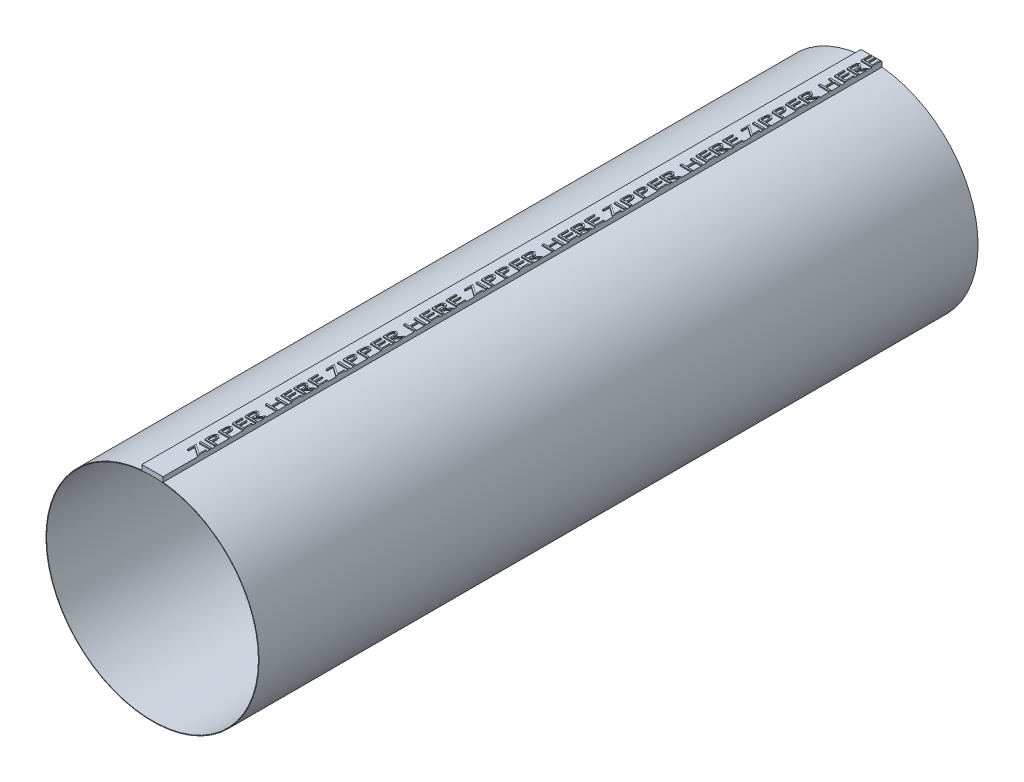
from build123d import *

# Parameters (mm, degrees)
SKETCH1_R                            = 127.635
SKETCH1_R_2                          = 127
BOSS_EXTRUDE1_DEPTH                  = 861.695
SKETCH2_W                            = 25.4
SKETCH2_H                            = 861.695
BOSS_EXTRUDE3_DEPTH                  = 5.08
BOSS_EXTRUDE3_DIRECTION_2_REACH      = 909.729
BOSS_EXTRUDE3_DIRECTION_2_END_RADIUS = 127.635
SKETCH4_W                            = 12.7
SKETCH4_H                            = 1.953846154
BOSS_EXTRUDE4_DEPTH                  = 1.27


with BuildPart() as part:
    # Sketch1 → Boss-Extrude1 (new body)
    with BuildSketch(Plane.XY):
        with Locations(Location((0, 0, 0), (0, 0, 180))):
            Circle(SKETCH1_R)
        with Locations(Location((0, 0, 0), (0, 0, 180))):
            Circle(SKETCH1_R_2, mode=Mode.SUBTRACT)
    extrude(amount=BOSS_EXTRUDE1_DEPTH)

    # Sketch2 → Boss-Extrude3 (add)
    with BuildSketch(Plane(origin=(0, 127.635, 0), x_dir=(1, 0, 0), z_dir=(0, 1, 0))):
        with Locations((0, -430.8475)):
            Rectangle(SKETCH2_W, SKETCH2_H)
    extrude(amount=BOSS_EXTRUDE3_DEPTH)

    # Boss-Extrude3 direction 2: up to this cylinder (the profile starts outside it)
    boss_extrude3_direction_2_end = Plane(origin=(0, 0, 430.8475), z_dir=(0, 0, -1)) * Cylinder(BOSS_EXTRUDE3_DIRECTION_2_END_RADIUS, 2075.728, mode=Mode.PRIVATE)
    # Sketch2 → Boss-Extrude3 direction 2 (add, up to the surface)
    with BuildSketch(Plane(origin=(0, 127.635, 0), x_dir=(1, 0, 0), z_dir=(0, 1, 0)), mode=Mode.PRIVATE) as boss_extrude3_direction_2_sk1:
        with Locations((0, -430.8475)):
            Rectangle(SKETCH2_W, SKETCH2_H)
    boss_extrude3_direction_2_tool1 = extrude(boss_extrude3_direction_2_sk1.sketch, amount=-BOSS_EXTRUDE3_DIRECTION_2_REACH, mode=Mode.PRIVATE) - boss_extrude3_direction_2_end
    add(boss_extrude3_direction_2_tool1.solids().sort_by_distance((0, 127.635, 430.8475))[0])
    add(boss_extrude3_direction_2_tool1.solids().sort_by_distance((0, 127.635, 430.8475))[1])

    # Sketch4 → Boss-Extrude4 (add)
    # profile 1 of 50: a face of its own
    with BuildSketch(Plane(origin=(0, 132.715, 0), x_dir=(1, 0, 0), z_dir=(0, 1, 0))):
        Polygon((0, -12.537179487), (0, -0.976923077), (1.302564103, -0.976923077), (1.302564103, -10.583333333), (5.21025641, -10.583333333), (5.21025641, -1.13974359), (6.512820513, -1.13974359), (6.512820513, -10.583333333), (11.397435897, -10.583333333), (11.397435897, -1.13974359), (12.7, -1.13974359), (12.7, -12.537179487), align=None)
    # profile 2 of 50: a face of its own
    with BuildSketch(Plane(origin=(0, 132.715, 0), x_dir=(1, 0, 0), z_dir=(0, 1, 0))):
        with BuildLine():
            Line((0, -29.470512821), (0, -25.425440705))
            add(Edge.make_bspline(
                [(0, -25.425440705), (0.000558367, -25.154921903), (0.001627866, -24.636769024), (0.007732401, -23.893823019), (0.025015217, -23.218856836), (0.039835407, -22.612320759), (0.067206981, -22.073923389), (0.092971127, -21.602974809), (0.127097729, -21.199846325), (0.158695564, -20.954578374), (0.172996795, -20.843569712)],
                knots=[0, 0, 0, 0, 1.415159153, 2.710601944, 3.886499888, 4.947209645, 5.884301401, 6.706450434, 7.414537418, 8, 8, 8, 8], degree=3))
            add(Edge.make_bspline(
                [(0.172996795, -20.843569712), (0.195811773, -20.695687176), (0.240497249, -20.40604406), (0.336384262, -19.985240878), (0.447933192, -19.585171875), (0.576328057, -19.205309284), (0.727613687, -18.848185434), (0.895345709, -18.511371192), (1.080894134, -18.195603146), (1.283091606, -17.902256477), (1.504006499, -17.639488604), (1.734198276, -17.405058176), (1.981872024, -17.209750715), (2.240032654, -17.049028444), (2.512142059, -16.924825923), (2.795621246, -16.835594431), (3.092312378, -16.780524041), (3.294337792, -16.773871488), (3.396334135, -16.770512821)],
                knots=[0, 0, 0, 0, 1.267890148, 2.483292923, 3.655221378, 4.787168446, 5.879136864, 6.939883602, 7.974121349, 8.981024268, 9.955597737, 10.880592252, 11.760652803, 12.622353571, 13.452169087, 14.288712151, 15.136024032, 16, 16, 16, 16], degree=3))
            add(Edge.make_bspline(
                [(3.396334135, -16.770512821), (3.482086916, -16.773191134), (3.65178731, -16.77849138), (3.902996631, -16.813749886), (4.144736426, -16.8782217), (4.378364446, -16.966437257), (4.606472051, -17.074016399), (4.822516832, -17.215193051), (5.034925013, -17.374050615), (5.235450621, -17.561258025), (5.425888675, -17.77042852), (5.606845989, -17.99948135), (5.775527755, -18.250178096), (5.930078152, -18.522806), (6.072616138, -18.817238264), (6.204731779, -19.132146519), (6.323826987, -19.468652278), (6.431834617, -19.827543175), (6.525242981, -20.215062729), (6.610398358, -20.63472374), (6.676247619, -21.090333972), (6.735799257, -21.579618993), (6.780694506, -22.1040467), (6.813299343, -22.663943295), (6.833808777, -23.258589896), (6.836883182, -23.666623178), (6.838461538, -23.876101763)],
                knots=[0, 0, 0, 0, 0.707777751, 1.400656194, 2.088211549, 2.768136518, 3.45995362, 4.164783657, 4.894105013, 5.646958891, 6.424744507, 7.227084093, 8.054048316, 8.916106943, 9.811366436, 10.752482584, 11.733185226, 12.756207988, 13.84434188, 15.022068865, 16.289085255, 17.642525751, 19.089840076, 20.632334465, 22.271087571, 24, 24, 24, 24], degree=3))
            Line((6.838461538, -23.876101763), (12.7, -16.607692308))
            Line((12.7, -16.607692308), (12.7, -19.088161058))
            Line((12.7, -19.088161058), (6.838461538, -26.356570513))
            Line((6.838461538, -26.356570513), (6.838461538, -27.516666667))
            Line((6.838461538, -27.516666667), (12.7, -27.516666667))
            Line((12.7, -27.516666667), (12.7, -29.470512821))
            Line((12.7, -29.470512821), (0, -29.470512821))
        make_face()
        with BuildLine():
            Line((1.302564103, -27.516666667), (5.535897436, -27.516666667))
            Line((5.535897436, -27.516666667), (5.553705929, -23.929527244))
            add(Edge.make_bspline(
                [(5.553705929, -23.929527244), (5.553764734, -23.76160533), (5.5538785, -23.436731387), (5.5392849, -22.966082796), (5.523026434, -22.529194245), (5.497622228, -22.126252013), (5.465037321, -21.757169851), (5.425003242, -21.421926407), (5.377329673, -21.120456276), (5.304095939, -20.77166003), (5.195783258, -20.379969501), (5.022176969, -19.960255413), (4.816545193, -19.592209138), (4.573012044, -19.285282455), (4.305950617, -19.036402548), (4.017980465, -18.857177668), (3.711289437, -18.744889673), (3.499853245, -18.731217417), (3.393790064, -18.724358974)],
                knots=[0, 0, 0, 0, 1.303539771, 2.521922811, 3.655213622, 4.697480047, 5.655909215, 6.53128532, 7.318138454, 8.024411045, 9.297674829, 10.46649221, 11.542740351, 12.559601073, 13.496234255, 14.362277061, 15.178465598, 16, 16, 16, 16], degree=3))
            add(Edge.make_bspline(
                [(3.393790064, -18.724358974), (3.291058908, -18.731174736), (3.084222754, -18.744897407), (2.785712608, -18.860003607), (2.502227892, -19.040520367), (2.24201203, -19.291314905), (2.006301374, -19.596881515), (1.805364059, -19.951297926), (1.640364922, -20.349597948), (1.531844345, -20.715041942), (1.466766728, -21.043574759), (1.419991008, -21.330957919), (1.386927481, -21.657332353), (1.356296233, -22.021174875), (1.330800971, -22.422343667), (1.313493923, -22.861733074), (1.303319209, -23.339253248), (1.302822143, -23.670874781), (1.302564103, -23.843028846)],
                knots=[0, 0, 0, 0, 0.811297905, 1.633445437, 2.499741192, 3.459343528, 4.478848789, 5.546661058, 6.675345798, 7.886516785, 8.558177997, 9.32657031, 10.191250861, 11.15490954, 12.218045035, 13.374027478, 14.636783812, 16, 16, 16, 16], degree=3))
            Line((1.302564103, -23.843028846), (1.302564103, -27.516666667))
        make_face(mode=Mode.SUBTRACT)
    # profile 3 of 50: a face of its own
    with BuildSketch(Plane(origin=(0, 132.715, 0), x_dir=(1, 0, 0), z_dir=(0, 1, 0))):
        Polygon((0, -44.45), (0, -32.88974359), (1.302564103, -32.88974359), (1.302564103, -42.496153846), (5.21025641, -42.496153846), (5.21025641, -33.052564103), (6.512820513, -33.052564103), (6.512820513, -42.496153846), (11.397435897, -42.496153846), (11.397435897, -33.052564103), (12.7, -33.052564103), (12.7, -44.45), align=None)
    # profile 4 of 50: a face of its own
    with BuildSketch(Plane(origin=(0, 132.715, 0), x_dir=(1, 0, 0), z_dir=(0, 1, 0))):
        Polygon((0, -63.5), (0, -61.546153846), (5.21025641, -61.546153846), (5.21025641, -51.288461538), (0, -51.288461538), (0, -49.334615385), (12.7, -49.334615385), (12.7, -51.288461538), (6.512820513, -51.288461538), (6.512820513, -61.546153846), (12.7, -61.546153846), (12.7, -63.5), align=None)
    # profile 5 of 50: a face of its own
    with BuildSketch(Plane(origin=(0, 132.715, 0), x_dir=(1, 0, 0), z_dir=(0, 1, 0))):
        with BuildLine():
            Line((0, -88.085897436), (0, -84.040825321))
            add(Edge.make_bspline(
                [(0, -84.040825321), (0.000558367, -83.770306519), (0.001627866, -83.252153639), (0.007732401, -82.509207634), (0.025015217, -81.834241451), (0.039835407, -81.227705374), (0.067206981, -80.689308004), (0.092971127, -80.218359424), (0.127097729, -79.81523094), (0.158695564, -79.56996299), (0.172996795, -79.458954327)],
                knots=[0, 0, 0, 0, 1.415159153, 2.710601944, 3.886499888, 4.947209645, 5.884301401, 6.706450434, 7.414537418, 8, 8, 8, 8], degree=3))
            add(Edge.make_bspline(
                [(0.172996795, -79.458954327), (0.195811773, -79.311071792), (0.240497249, -79.021428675), (0.336384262, -78.600625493), (0.447933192, -78.200556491), (0.576328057, -77.8206939), (0.727613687, -77.463570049), (0.895345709, -77.126755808), (1.080894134, -76.810987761), (1.283091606, -76.517641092), (1.504006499, -76.25487322), (1.734198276, -76.020442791), (1.981872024, -75.82513533), (2.240032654, -75.664413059), (2.512142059, -75.540210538), (2.795621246, -75.450979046), (3.092312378, -75.395908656), (3.294337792, -75.389256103), (3.396334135, -75.385897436)],
                knots=[0, 0, 0, 0, 1.267890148, 2.483292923, 3.655221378, 4.787168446, 5.879136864, 6.939883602, 7.974121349, 8.981024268, 9.955597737, 10.880592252, 11.760652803, 12.622353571, 13.452169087, 14.288712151, 15.136024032, 16, 16, 16, 16], degree=3))
            add(Edge.make_bspline(
                [(3.396334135, -75.385897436), (3.482086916, -75.388575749), (3.65178731, -75.393875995), (3.902996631, -75.429134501), (4.144736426, -75.493606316), (4.378364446, -75.581821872), (4.606472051, -75.689401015), (4.822516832, -75.830577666), (5.034925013, -75.989435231), (5.235450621, -76.17664264), (5.425888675, -76.385813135), (5.606845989, -76.614865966), (5.775527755, -76.865562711), (5.930078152, -77.138190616), (6.072616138, -77.43262288), (6.204731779, -77.747531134), (6.323826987, -78.084036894), (6.431834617, -78.442927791), (6.525242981, -78.830447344), (6.610398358, -79.250108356), (6.676247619, -79.705718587), (6.735799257, -80.195003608), (6.780694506, -80.719431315), (6.813299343, -81.27932791), (6.833808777, -81.873974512), (6.836883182, -82.282007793), (6.838461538, -82.491486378)],
                knots=[0, 0, 0, 0, 0.707777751, 1.400656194, 2.088211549, 2.768136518, 3.45995362, 4.164783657, 4.894105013, 5.646958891, 6.424744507, 7.227084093, 8.054048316, 8.916106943, 9.811366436, 10.752482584, 11.733185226, 12.756207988, 13.84434188, 15.022068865, 16.289085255, 17.642525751, 19.089840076, 20.632334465, 22.271087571, 24, 24, 24, 24], degree=3))
            Line((6.838461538, -82.491486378), (12.7, -75.223076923))
            Line((12.7, -75.223076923), (12.7, -77.703545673))
            Line((12.7, -77.703545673), (6.838461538, -84.971955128))
            Line((6.838461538, -84.971955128), (6.838461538, -86.132051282))
            Line((6.838461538, -86.132051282), (12.7, -86.132051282))
            Line((12.7, -86.132051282), (12.7, -88.085897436))
            Line((12.7, -88.085897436), (0, -88.085897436))
        make_face()
        with BuildLine():
            Line((1.302564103, -86.132051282), (5.535897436, -86.132051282))
            Line((5.535897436, -86.132051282), (5.553705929, -82.544911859))
            add(Edge.make_bspline(
                [(5.553705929, -82.544911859), (5.553764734, -82.376989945), (5.5538785, -82.052116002), (5.5392849, -81.581467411), (5.523026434, -81.144578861), (5.497622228, -80.741636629), (5.465037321, -80.372554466), (5.425003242, -80.037311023), (5.377329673, -79.735840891), (5.304095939, -79.387044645), (5.195783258, -78.995354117), (5.022176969, -78.575640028), (4.816545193, -78.207593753), (4.573012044, -77.900667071), (4.305950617, -77.651787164), (4.017980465, -77.472562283), (3.711289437, -77.360274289), (3.499853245, -77.346602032), (3.393790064, -77.33974359)],
                knots=[0, 0, 0, 0, 1.303539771, 2.521922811, 3.655213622, 4.697480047, 5.655909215, 6.53128532, 7.318138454, 8.024411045, 9.297674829, 10.46649221, 11.542740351, 12.559601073, 13.496234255, 14.362277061, 15.178465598, 16, 16, 16, 16], degree=3))
            add(Edge.make_bspline(
                [(3.393790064, -77.33974359), (3.291058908, -77.346559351), (3.084222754, -77.360282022), (2.785712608, -77.475388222), (2.502227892, -77.655904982), (2.24201203, -77.90669952), (2.006301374, -78.21226613), (1.805364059, -78.566682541), (1.640364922, -78.964982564), (1.531844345, -79.330426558), (1.466766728, -79.658959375), (1.419991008, -79.946342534), (1.386927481, -80.272716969), (1.356296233, -80.63655949), (1.330800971, -81.037728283), (1.313493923, -81.477117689), (1.303319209, -81.954637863), (1.302822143, -82.286259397), (1.302564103, -82.458413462)],
                knots=[0, 0, 0, 0, 0.811297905, 1.633445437, 2.499741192, 3.459343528, 4.478848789, 5.546661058, 6.675345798, 7.886516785, 8.558177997, 9.32657031, 10.191250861, 11.15490954, 12.218045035, 13.374027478, 14.636783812, 16, 16, 16, 16], degree=3))
            Line((1.302564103, -82.458413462), (1.302564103, -86.132051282))
        make_face(mode=Mode.SUBTRACT)
    # profile 6 of 50: a face of its own
    with BuildSketch(Plane(origin=(0, 132.715, 0), x_dir=(1, 0, 0), z_dir=(0, 1, 0))):
        Polygon((0, -103.065384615), (0, -91.505128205), (1.302564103, -91.505128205), (1.302564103, -101.111538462), (5.21025641, -101.111538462), (5.21025641, -91.667948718), (6.512820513, -91.667948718), (6.512820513, -101.111538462), (11.397435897, -101.111538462), (11.397435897, -91.667948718), (12.7, -91.667948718), (12.7, -103.065384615), align=None)
    # profile 7 of 50: a face of its own
    with BuildSketch(Plane(origin=(0, 132.715, 0), x_dir=(1, 0, 0), z_dir=(0, 1, 0))):
        with BuildLine():
            Line((0, -119.51025641), (0, -115.564403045))
            add(Edge.make_bspline(
                [(0, -115.564403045), (0.000189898, -115.293030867), (0.000553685, -114.773161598), (0.011453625, -114.028579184), (0.026115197, -113.352655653), (0.04642248, -112.746290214), (0.070056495, -112.208394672), (0.104030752, -111.740330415), (0.138704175, -111.340198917), (0.174532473, -111.097741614), (0.190805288, -110.987620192)],
                knots=[0, 0, 0, 0, 1.420744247, 2.721728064, 3.898577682, 4.960285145, 5.898135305, 6.717095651, 7.417319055, 8, 8, 8, 8], degree=3))
            add(Edge.make_bspline(
                [(0.190805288, -110.987620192), (0.214708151, -110.849086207), (0.261593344, -110.577353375), (0.356927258, -110.181773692), (0.468064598, -109.805252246), (0.597403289, -109.448063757), (0.74646104, -109.11173536), (0.907418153, -108.791750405), (1.092623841, -108.493836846), (1.290839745, -108.214754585), (1.507302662, -107.962085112), (1.736773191, -107.740202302), (1.982790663, -107.554817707), (2.239815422, -107.399411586), (2.514278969, -107.284543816), (2.798659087, -107.194140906), (3.098842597, -107.147445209), (3.302918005, -107.139785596), (3.406510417, -107.135897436)],
                knots=[0, 0, 0, 0, 1.232097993, 2.416746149, 3.564574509, 4.672243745, 5.744084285, 6.788054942, 7.809333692, 8.816115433, 9.786134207, 10.722053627, 11.608200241, 12.481531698, 13.34736388, 14.210383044, 15.09155768, 16, 16, 16, 16], degree=3))
            add(Edge.make_bspline(
                [(3.406510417, -107.135897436), (3.511065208, -107.13820347), (3.716397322, -107.142732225), (4.016376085, -107.197136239), (4.302979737, -107.277056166), (4.576024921, -107.392857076), (4.832866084, -107.544245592), (5.076841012, -107.726825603), (5.306653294, -107.94147842), (5.519250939, -108.189560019), (5.718159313, -108.465423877), (5.900330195, -108.767841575), (6.065613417, -109.094533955), (6.21440673, -109.445277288), (6.341957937, -109.821927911), (6.457473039, -110.22223664), (6.553687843, -110.648062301), (6.604049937, -110.941575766), (6.629847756, -111.091927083)],
                knots=[0, 0, 0, 0, 0.897193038, 1.761971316, 2.610609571, 3.449591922, 4.301787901, 5.165860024, 6.062786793, 6.997644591, 7.968242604, 8.981568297, 10.027475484, 11.111364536, 12.251856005, 13.441751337, 14.68954544, 16, 16, 16, 16], degree=3))
            add(Edge.make_bspline(
                [(6.629847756, -111.091927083), (6.646757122, -111.216491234), (6.683838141, -111.489651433), (6.725516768, -111.936893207), (6.759666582, -112.457829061), (6.791482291, -113.051419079), (6.808453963, -113.719923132), (6.82814228, -114.461026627), (6.837568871, -115.276051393), (6.838155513, -115.843401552), (6.838461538, -116.139362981)],
                knots=[0, 0, 0, 0, 0.596751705, 1.308633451, 2.13187847, 3.075211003, 4.130526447, 5.306469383, 6.594904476, 8, 8, 8, 8], degree=3))
            Line((6.838461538, -116.139362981), (6.838461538, -117.556410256))
            Line((6.838461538, -117.556410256), (12.7, -117.556410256))
            Line((12.7, -117.556410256), (12.7, -119.51025641))
            Line((12.7, -119.51025641), (0, -119.51025641))
        make_face()
        with BuildLine():
            Line((1.302564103, -117.556410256), (5.535897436, -117.556410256))
            Line((5.535897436, -117.556410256), (5.563882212, -114.154987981))
            add(Edge.make_bspline(
                [(5.563882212, -114.154987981), (5.56394405, -113.988762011), (5.564063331, -113.668127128), (5.549562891, -113.205106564), (5.53303618, -112.775858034), (5.507982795, -112.381379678), (5.475546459, -112.020723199), (5.434271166, -111.695976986), (5.390810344, -111.404142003), (5.316953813, -111.068931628), (5.205968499, -110.694212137), (5.04140669, -110.286820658), (4.83016972, -109.93536828), (4.589513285, -109.636472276), (4.323675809, -109.393338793), (4.03436183, -109.220929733), (3.729399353, -109.106834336), (3.517731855, -109.095451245), (3.411598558, -109.08974359)],
                knots=[0, 0, 0, 0, 1.318031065, 2.54236289, 3.673069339, 4.724253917, 5.676438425, 6.543880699, 7.319977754, 8.015083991, 9.263988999, 10.415441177, 11.48912002, 12.502589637, 13.450275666, 14.327901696, 15.161584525, 16, 16, 16, 16], degree=3))
            add(Edge.make_bspline(
                [(3.411598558, -109.08974359), (3.308915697, -109.095748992), (3.101567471, -109.107875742), (2.801850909, -109.220249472), (2.516625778, -109.395005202), (2.252223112, -109.636104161), (2.012959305, -109.929631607), (1.806614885, -110.271331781), (1.641016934, -110.656962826), (1.53167412, -111.011557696), (1.466935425, -111.329246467), (1.420061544, -111.606418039), (1.386977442, -111.920096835), (1.356332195, -112.268673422), (1.33082735, -112.652034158), (1.313502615, -113.07107499), (1.303323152, -113.525702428), (1.302823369, -113.841213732), (1.302564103, -114.004887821)],
                knots=[0, 0, 0, 0, 0.834745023, 1.685606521, 2.576342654, 3.550972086, 4.587895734, 5.655342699, 6.795014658, 8.002599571, 8.673996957, 9.438022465, 10.294151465, 11.245236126, 12.291801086, 13.427015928, 14.665243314, 16, 16, 16, 16], degree=3))
            Line((1.302564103, -114.004887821), (1.302564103, -117.556410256))
        make_face(mode=Mode.SUBTRACT)
    # profile 8 of 50: a face of its own
    with BuildSketch(Plane(origin=(0, 132.715, 0), x_dir=(1, 0, 0), z_dir=(0, 1, 0))):
        with BuildLine():
            Line((0, -135.955128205), (0, -132.00927484))
            add(Edge.make_bspline(
                [(0, -132.00927484), (0.000189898, -131.737902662), (0.000553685, -131.218033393), (0.011453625, -130.473450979), (0.026115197, -129.797527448), (0.04642248, -129.191162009), (0.070056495, -128.653266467), (0.104030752, -128.18520221), (0.138704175, -127.785070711), (0.174532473, -127.542613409), (0.190805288, -127.432491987)],
                knots=[0, 0, 0, 0, 1.420744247, 2.721728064, 3.898577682, 4.960285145, 5.898135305, 6.717095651, 7.417319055, 8, 8, 8, 8], degree=3))
            add(Edge.make_bspline(
                [(0.190805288, -127.432491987), (0.214708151, -127.293958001), (0.261593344, -127.02222517), (0.356927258, -126.626645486), (0.468064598, -126.250124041), (0.597403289, -125.892935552), (0.74646104, -125.556607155), (0.907418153, -125.2366222), (1.092623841, -124.938708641), (1.290839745, -124.65962638), (1.507302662, -124.406956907), (1.736773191, -124.185074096), (1.982790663, -123.999689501), (2.239815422, -123.844283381), (2.514278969, -123.729415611), (2.798659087, -123.639012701), (3.098842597, -123.592317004), (3.302918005, -123.584657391), (3.406510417, -123.580769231)],
                knots=[0, 0, 0, 0, 1.232097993, 2.416746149, 3.564574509, 4.672243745, 5.744084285, 6.788054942, 7.809333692, 8.816115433, 9.786134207, 10.722053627, 11.608200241, 12.481531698, 13.34736388, 14.210383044, 15.09155768, 16, 16, 16, 16], degree=3))
            add(Edge.make_bspline(
                [(3.406510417, -123.580769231), (3.511065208, -123.583075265), (3.716397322, -123.58760402), (4.016376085, -123.642008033), (4.302979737, -123.721927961), (4.576024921, -123.837728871), (4.832866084, -123.989117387), (5.076841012, -124.171697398), (5.306653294, -124.386350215), (5.519250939, -124.634431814), (5.718159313, -124.910295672), (5.900330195, -125.21271337), (6.065613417, -125.53940575), (6.21440673, -125.890149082), (6.341957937, -126.266799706), (6.457473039, -126.667108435), (6.553687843, -127.092934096), (6.604049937, -127.38644756), (6.629847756, -127.536798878)],
                knots=[0, 0, 0, 0, 0.897193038, 1.761971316, 2.610609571, 3.449591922, 4.301787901, 5.165860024, 6.062786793, 6.997644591, 7.968242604, 8.981568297, 10.027475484, 11.111364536, 12.251856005, 13.441751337, 14.68954544, 16, 16, 16, 16], degree=3))
            add(Edge.make_bspline(
                [(6.629847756, -127.536798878), (6.646757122, -127.661363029), (6.683838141, -127.934523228), (6.725516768, -128.381765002), (6.759666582, -128.902700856), (6.791482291, -129.496290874), (6.808453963, -130.164794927), (6.82814228, -130.905898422), (6.837568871, -131.720923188), (6.838155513, -132.288273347), (6.838461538, -132.584234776)],
                knots=[0, 0, 0, 0, 0.596751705, 1.308633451, 2.13187847, 3.075211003, 4.130526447, 5.306469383, 6.594904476, 8, 8, 8, 8], degree=3))
            Line((6.838461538, -132.584234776), (6.838461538, -134.001282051))
            Line((6.838461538, -134.001282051), (12.7, -134.001282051))
            Line((12.7, -134.001282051), (12.7, -135.955128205))
            Line((12.7, -135.955128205), (0, -135.955128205))
        make_face()
        with BuildLine():
            Line((1.302564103, -134.001282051), (5.535897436, -134.001282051))
            Line((5.535897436, -134.001282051), (5.563882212, -130.599859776))
            add(Edge.make_bspline(
                [(5.563882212, -130.599859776), (5.56394405, -130.433633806), (5.564063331, -130.112998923), (5.549562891, -129.649978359), (5.53303618, -129.220729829), (5.507982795, -128.826251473), (5.475546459, -128.465594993), (5.434271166, -128.140848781), (5.390810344, -127.849013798), (5.316953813, -127.513803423), (5.205968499, -127.139083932), (5.04140669, -126.731692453), (4.83016972, -126.380240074), (4.589513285, -126.081344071), (4.323675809, -125.838210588), (4.03436183, -125.665801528), (3.729399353, -125.551706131), (3.517731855, -125.54032304), (3.411598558, -125.534615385)],
                knots=[0, 0, 0, 0, 1.318031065, 2.54236289, 3.673069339, 4.724253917, 5.676438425, 6.543880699, 7.319977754, 8.015083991, 9.263988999, 10.415441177, 11.48912002, 12.502589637, 13.450275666, 14.327901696, 15.161584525, 16, 16, 16, 16], degree=3))
            add(Edge.make_bspline(
                [(3.411598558, -125.534615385), (3.308915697, -125.540620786), (3.101567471, -125.552747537), (2.801850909, -125.665121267), (2.516625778, -125.839876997), (2.252223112, -126.080975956), (2.012959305, -126.374503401), (1.806614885, -126.716203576), (1.641016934, -127.10183462), (1.53167412, -127.456429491), (1.466935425, -127.774118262), (1.420061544, -128.051289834), (1.386977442, -128.36496863), (1.356332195, -128.713545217), (1.33082735, -129.096905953), (1.313502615, -129.515946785), (1.303323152, -129.970574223), (1.302823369, -130.286085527), (1.302564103, -130.449759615)],
                knots=[0, 0, 0, 0, 0.834745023, 1.685606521, 2.576342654, 3.550972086, 4.587895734, 5.655342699, 6.795014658, 8.002599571, 8.673996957, 9.438022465, 10.294151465, 11.245236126, 12.291801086, 13.427015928, 14.665243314, 16, 16, 16, 16], degree=3))
            Line((1.302564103, -130.449759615), (1.302564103, -134.001282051))
        make_face(mode=Mode.SUBTRACT)
    # profile 9 of 50: a face of its own
    with BuildSketch(Plane(origin=(0, 132.715, 0), x_dir=(1, 0, 0), z_dir=(0, 1, 0))):
        with Locations((6.35, -141.653846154)):
            Rectangle(SKETCH4_W, SKETCH4_H)
    # profile 10 of 50: a face of its own
    with BuildSketch(Plane(origin=(0, 132.715, 0), x_dir=(1, 0, 0), z_dir=(0, 1, 0))):
        Polygon((1.302564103, -156.470512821), (0, -156.470512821), (0, -146.212820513), (11.397435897, -154.226642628), (11.397435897, -146.375641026), (12.7, -146.375641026), (12.7, -157.284615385), (1.302564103, -149.270793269), align=None)
    # profile 11 of 50: a face of its own
    with BuildSketch(Plane(origin=(0, 132.715, 0), x_dir=(1, 0, 0), z_dir=(0, 1, 0))):
        Polygon((0, -178.288461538), (0, -166.728205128), (1.302564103, -166.728205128), (1.302564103, -176.334615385), (5.21025641, -176.334615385), (5.21025641, -166.891025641), (6.512820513, -166.891025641), (6.512820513, -176.334615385), (11.397435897, -176.334615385), (11.397435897, -166.891025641), (12.7, -166.891025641), (12.7, -178.288461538), align=None)
    # profile 12 of 50: a face of its own
    with BuildSketch(Plane(origin=(0, 132.715, 0), x_dir=(1, 0, 0), z_dir=(0, 1, 0))):
        with BuildLine():
            Line((0, -195.221794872), (0, -191.176722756))
            add(Edge.make_bspline(
                [(0, -191.176722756), (0.000558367, -190.906203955), (0.001627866, -190.388051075), (0.007732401, -189.64510507), (0.025015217, -188.970138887), (0.039835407, -188.36360281), (0.067206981, -187.82520544), (0.092971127, -187.35425686), (0.127097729, -186.951128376), (0.158695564, -186.705860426), (0.172996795, -186.594851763)],
                knots=[0, 0, 0, 0, 1.415159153, 2.710601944, 3.886499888, 4.947209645, 5.884301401, 6.706450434, 7.414537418, 8, 8, 8, 8], degree=3))
            add(Edge.make_bspline(
                [(0.172996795, -186.594851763), (0.195811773, -186.446969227), (0.240497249, -186.157326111), (0.336384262, -185.736522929), (0.447933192, -185.336453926), (0.576328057, -184.956591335), (0.727613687, -184.599467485), (0.895345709, -184.262653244), (1.080894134, -183.946885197), (1.283091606, -183.653538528), (1.504006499, -183.390770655), (1.734198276, -183.156340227), (1.981872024, -182.961032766), (2.240032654, -182.800310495), (2.512142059, -182.676107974), (2.795621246, -182.586876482), (3.092312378, -182.531806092), (3.294337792, -182.525153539), (3.396334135, -182.521794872)],
                knots=[0, 0, 0, 0, 1.267890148, 2.483292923, 3.655221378, 4.787168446, 5.879136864, 6.939883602, 7.974121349, 8.981024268, 9.955597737, 10.880592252, 11.760652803, 12.622353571, 13.452169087, 14.288712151, 15.136024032, 16, 16, 16, 16], degree=3))
            add(Edge.make_bspline(
                [(3.396334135, -182.521794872), (3.482086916, -182.524473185), (3.65178731, -182.529773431), (3.902996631, -182.565031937), (4.144736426, -182.629503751), (4.378364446, -182.717719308), (4.606472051, -182.825298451), (4.822516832, -182.966475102), (5.034925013, -183.125332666), (5.235450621, -183.312540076), (5.425888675, -183.521710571), (5.606845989, -183.750763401), (5.775527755, -184.001460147), (5.930078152, -184.274088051), (6.072616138, -184.568520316), (6.204731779, -184.88342857), (6.323826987, -185.21993433), (6.431834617, -185.578825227), (6.525242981, -185.96634478), (6.610398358, -186.386005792), (6.676247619, -186.841616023), (6.735799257, -187.330901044), (6.780694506, -187.855328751), (6.813299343, -188.415225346), (6.833808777, -189.009871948), (6.836883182, -189.417905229), (6.838461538, -189.627383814)],
                knots=[0, 0, 0, 0, 0.707777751, 1.400656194, 2.088211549, 2.768136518, 3.45995362, 4.164783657, 4.894105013, 5.646958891, 6.424744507, 7.227084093, 8.054048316, 8.916106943, 9.811366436, 10.752482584, 11.733185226, 12.756207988, 13.84434188, 15.022068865, 16.289085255, 17.642525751, 19.089840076, 20.632334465, 22.271087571, 24, 24, 24, 24], degree=3))
            Line((6.838461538, -189.627383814), (12.7, -182.358974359))
            Line((12.7, -182.358974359), (12.7, -184.839443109))
            Line((12.7, -184.839443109), (6.838461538, -192.107852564))
            Line((6.838461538, -192.107852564), (6.838461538, -193.267948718))
            Line((6.838461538, -193.267948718), (12.7, -193.267948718))
            Line((12.7, -193.267948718), (12.7, -195.221794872))
            Line((12.7, -195.221794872), (0, -195.221794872))
        make_face()
        with BuildLine():
            Line((1.302564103, -193.267948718), (5.535897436, -193.267948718))
            Line((5.535897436, -193.267948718), (5.553705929, -189.680809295))
            add(Edge.make_bspline(
                [(5.553705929, -189.680809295), (5.553764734, -189.512887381), (5.5538785, -189.188013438), (5.5392849, -188.717364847), (5.523026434, -188.280476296), (5.497622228, -187.877534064), (5.465037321, -187.508451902), (5.425003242, -187.173208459), (5.377329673, -186.871738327), (5.304095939, -186.522942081), (5.195783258, -186.131251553), (5.022176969, -185.711537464), (4.816545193, -185.343491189), (4.573012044, -185.036564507), (4.305950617, -184.7876846), (4.017980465, -184.608459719), (3.711289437, -184.496171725), (3.499853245, -184.482499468), (3.393790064, -184.475641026)],
                knots=[0, 0, 0, 0, 1.303539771, 2.521922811, 3.655213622, 4.697480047, 5.655909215, 6.53128532, 7.318138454, 8.024411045, 9.297674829, 10.46649221, 11.542740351, 12.559601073, 13.496234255, 14.362277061, 15.178465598, 16, 16, 16, 16], degree=3))
            add(Edge.make_bspline(
                [(3.393790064, -184.475641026), (3.291058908, -184.482456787), (3.084222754, -184.496179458), (2.785712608, -184.611285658), (2.502227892, -184.791802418), (2.24201203, -185.042596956), (2.006301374, -185.348163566), (1.805364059, -185.702579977), (1.640364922, -186.10088), (1.531844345, -186.466323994), (1.466766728, -186.794856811), (1.419991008, -187.08223997), (1.386927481, -187.408614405), (1.356296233, -187.772456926), (1.330800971, -188.173625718), (1.313493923, -188.613015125), (1.303319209, -189.090535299), (1.302822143, -189.422156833), (1.302564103, -189.594310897)],
                knots=[0, 0, 0, 0, 0.811297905, 1.633445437, 2.499741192, 3.459343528, 4.478848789, 5.546661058, 6.675345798, 7.886516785, 8.558177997, 9.32657031, 10.191250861, 11.15490954, 12.218045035, 13.374027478, 14.636783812, 16, 16, 16, 16], degree=3))
            Line((1.302564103, -189.594310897), (1.302564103, -193.267948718))
        make_face(mode=Mode.SUBTRACT)
    # profile 13 of 50: a face of its own
    with BuildSketch(Plane(origin=(0, 132.715, 0), x_dir=(1, 0, 0), z_dir=(0, 1, 0))):
        Polygon((0, -210.201282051), (0, -198.641025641), (1.302564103, -198.641025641), (1.302564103, -208.247435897), (5.21025641, -208.247435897), (5.21025641, -198.803846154), (6.512820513, -198.803846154), (6.512820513, -208.247435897), (11.397435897, -208.247435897), (11.397435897, -198.803846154), (12.7, -198.803846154), (12.7, -210.201282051), align=None)
    # profile 14 of 50: a face of its own
    with BuildSketch(Plane(origin=(0, 132.715, 0), x_dir=(1, 0, 0), z_dir=(0, 1, 0))):
        Polygon((0, -229.251282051), (0, -227.297435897), (5.21025641, -227.297435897), (5.21025641, -217.03974359), (0, -217.03974359), (0, -215.085897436), (12.7, -215.085897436), (12.7, -217.03974359), (6.512820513, -217.03974359), (6.512820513, -227.297435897), (12.7, -227.297435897), (12.7, -229.251282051), align=None)
    # profile 15 of 50: a face of its own
    with BuildSketch(Plane(origin=(0, 132.715, 0), x_dir=(1, 0, 0), z_dir=(0, 1, 0))):
        with BuildLine():
            Line((0, -253.837179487), (0, -249.792107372))
            add(Edge.make_bspline(
                [(0, -249.792107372), (0.000558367, -249.52158857), (0.001627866, -249.003435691), (0.007732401, -248.260489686), (0.025015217, -247.585523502), (0.039835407, -246.978987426), (0.067206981, -246.440590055), (0.092971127, -245.969641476), (0.127097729, -245.566512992), (0.158695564, -245.321245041), (0.172996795, -245.210236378)],
                knots=[0, 0, 0, 0, 1.415159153, 2.710601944, 3.886499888, 4.947209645, 5.884301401, 6.706450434, 7.414537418, 8, 8, 8, 8], degree=3))
            add(Edge.make_bspline(
                [(0.172996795, -245.210236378), (0.195811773, -245.062353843), (0.240497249, -244.772710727), (0.336384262, -244.351907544), (0.447933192, -243.951838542), (0.576328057, -243.571975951), (0.727613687, -243.214852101), (0.895345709, -242.878037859), (1.080894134, -242.562269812), (1.283091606, -242.268923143), (1.504006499, -242.006155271), (1.734198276, -241.771724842), (1.981872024, -241.576417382), (2.240032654, -241.41569511), (2.512142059, -241.29149259), (2.795621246, -241.202261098), (3.092312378, -241.147190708), (3.294337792, -241.140538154), (3.396334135, -241.137179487)],
                knots=[0, 0, 0, 0, 1.267890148, 2.483292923, 3.655221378, 4.787168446, 5.879136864, 6.939883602, 7.974121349, 8.981024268, 9.955597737, 10.880592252, 11.760652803, 12.622353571, 13.452169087, 14.288712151, 15.136024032, 16, 16, 16, 16], degree=3))
            add(Edge.make_bspline(
                [(3.396334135, -241.137179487), (3.482086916, -241.1398578), (3.65178731, -241.145158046), (3.902996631, -241.180416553), (4.144736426, -241.244888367), (4.378364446, -241.333103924), (4.606472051, -241.440683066), (4.822516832, -241.581859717), (5.034925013, -241.740717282), (5.235450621, -241.927924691), (5.425888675, -242.137095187), (5.606845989, -242.366148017), (5.775527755, -242.616844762), (5.930078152, -242.889472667), (6.072616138, -243.183904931), (6.204731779, -243.498813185), (6.323826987, -243.835318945), (6.431834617, -244.194209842), (6.525242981, -244.581729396), (6.610398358, -245.001390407), (6.676247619, -245.457000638), (6.735799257, -245.946285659), (6.780694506, -246.470713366), (6.813299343, -247.030609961), (6.833808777, -247.625256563), (6.836883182, -248.033289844), (6.838461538, -248.242768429)],
                knots=[0, 0, 0, 0, 0.707777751, 1.400656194, 2.088211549, 2.768136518, 3.45995362, 4.164783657, 4.894105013, 5.646958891, 6.424744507, 7.227084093, 8.054048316, 8.916106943, 9.811366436, 10.752482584, 11.733185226, 12.756207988, 13.84434188, 15.022068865, 16.289085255, 17.642525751, 19.089840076, 20.632334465, 22.271087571, 24, 24, 24, 24], degree=3))
            Line((6.838461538, -248.242768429), (12.7, -240.974358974))
            Line((12.7, -240.974358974), (12.7, -243.454827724))
            Line((12.7, -243.454827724), (6.838461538, -250.723237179))
            Line((6.838461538, -250.723237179), (6.838461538, -251.883333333))
            Line((6.838461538, -251.883333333), (12.7, -251.883333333))
            Line((12.7, -251.883333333), (12.7, -253.837179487))
            Line((12.7, -253.837179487), (0, -253.837179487))
        make_face()
        with BuildLine():
            Line((1.302564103, -251.883333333), (5.535897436, -251.883333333))
            Line((5.535897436, -251.883333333), (5.553705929, -248.29619391))
            add(Edge.make_bspline(
                [(5.553705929, -248.29619391), (5.553764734, -248.128271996), (5.5538785, -247.803398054), (5.5392849, -247.332749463), (5.523026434, -246.895860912), (5.497622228, -246.49291868), (5.465037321, -246.123836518), (5.425003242, -245.788593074), (5.377329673, -245.487122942), (5.304095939, -245.138326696), (5.195783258, -244.746636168), (5.022176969, -244.326922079), (4.816545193, -243.958875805), (4.573012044, -243.651949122), (4.305950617, -243.403069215), (4.017980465, -243.223844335), (3.711289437, -243.11155634), (3.499853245, -243.097884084), (3.393790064, -243.091025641)],
                knots=[0, 0, 0, 0, 1.303539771, 2.521922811, 3.655213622, 4.697480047, 5.655909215, 6.53128532, 7.318138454, 8.024411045, 9.297674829, 10.46649221, 11.542740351, 12.559601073, 13.496234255, 14.362277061, 15.178465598, 16, 16, 16, 16], degree=3))
            add(Edge.make_bspline(
                [(3.393790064, -243.091025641), (3.291058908, -243.097841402), (3.084222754, -243.111564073), (2.785712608, -243.226670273), (2.502227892, -243.407187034), (2.24201203, -243.657981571), (2.006301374, -243.963548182), (1.805364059, -244.317964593), (1.640364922, -244.716264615), (1.531844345, -245.081708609), (1.466766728, -245.410241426), (1.419991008, -245.697624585), (1.386927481, -246.02399902), (1.356296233, -246.387841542), (1.330800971, -246.789010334), (1.313493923, -247.22839974), (1.303319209, -247.705919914), (1.302822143, -248.037541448), (1.302564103, -248.209695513)],
                knots=[0, 0, 0, 0, 0.811297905, 1.633445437, 2.499741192, 3.459343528, 4.478848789, 5.546661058, 6.675345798, 7.886516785, 8.558177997, 9.32657031, 10.191250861, 11.15490954, 12.218045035, 13.374027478, 14.636783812, 16, 16, 16, 16], degree=3))
            Line((1.302564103, -248.209695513), (1.302564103, -251.883333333))
        make_face(mode=Mode.SUBTRACT)
    # profile 16 of 50: a face of its own
    with BuildSketch(Plane(origin=(0, 132.715, 0), x_dir=(1, 0, 0), z_dir=(0, 1, 0))):
        Polygon((0, -268.816666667), (0, -257.256410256), (1.302564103, -257.256410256), (1.302564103, -266.862820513), (5.21025641, -266.862820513), (5.21025641, -257.419230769), (6.512820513, -257.419230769), (6.512820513, -266.862820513), (11.397435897, -266.862820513), (11.397435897, -257.419230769), (12.7, -257.419230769), (12.7, -268.816666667), align=None)
    # profile 17 of 50: a face of its own
    with BuildSketch(Plane(origin=(0, 132.715, 0), x_dir=(1, 0, 0), z_dir=(0, 1, 0))):
        with BuildLine():
            Line((0, -285.261538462), (0, -281.315685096))
            add(Edge.make_bspline(
                [(0, -281.315685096), (0.000189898, -281.044312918), (0.000553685, -280.524443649), (0.011453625, -279.779861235), (0.026115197, -279.103937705), (0.04642248, -278.497572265), (0.070056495, -277.959676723), (0.104030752, -277.491612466), (0.138704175, -277.091480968), (0.174532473, -276.849023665), (0.190805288, -276.738902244)],
                knots=[0, 0, 0, 0, 1.420744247, 2.721728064, 3.898577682, 4.960285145, 5.898135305, 6.717095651, 7.417319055, 8, 8, 8, 8], degree=3))
            add(Edge.make_bspline(
                [(0.190805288, -276.738902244), (0.214708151, -276.600368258), (0.261593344, -276.328635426), (0.356927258, -275.933055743), (0.468064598, -275.556534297), (0.597403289, -275.199345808), (0.74646104, -274.863017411), (0.907418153, -274.543032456), (1.092623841, -274.245118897), (1.290839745, -273.966036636), (1.507302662, -273.713367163), (1.736773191, -273.491484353), (1.982790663, -273.306099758), (2.239815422, -273.150693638), (2.514278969, -273.035825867), (2.798659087, -272.945422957), (3.098842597, -272.89872726), (3.302918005, -272.891067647), (3.406510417, -272.887179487)],
                knots=[0, 0, 0, 0, 1.232097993, 2.416746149, 3.564574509, 4.672243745, 5.744084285, 6.788054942, 7.809333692, 8.816115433, 9.786134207, 10.722053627, 11.608200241, 12.481531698, 13.34736388, 14.210383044, 15.09155768, 16, 16, 16, 16], degree=3))
            add(Edge.make_bspline(
                [(3.406510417, -272.887179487), (3.511065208, -272.889485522), (3.716397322, -272.894014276), (4.016376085, -272.94841829), (4.302979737, -273.028338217), (4.576024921, -273.144139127), (4.832866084, -273.295527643), (5.076841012, -273.478107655), (5.306653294, -273.692760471), (5.519250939, -273.940842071), (5.718159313, -274.216705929), (5.900330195, -274.519123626), (6.065613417, -274.845816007), (6.21440673, -275.196559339), (6.341957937, -275.573209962), (6.457473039, -275.973518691), (6.553687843, -276.399344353), (6.604049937, -276.692857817), (6.629847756, -276.843209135)],
                knots=[0, 0, 0, 0, 0.897193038, 1.761971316, 2.610609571, 3.449591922, 4.301787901, 5.165860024, 6.062786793, 6.997644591, 7.968242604, 8.981568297, 10.027475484, 11.111364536, 12.251856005, 13.441751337, 14.68954544, 16, 16, 16, 16], degree=3))
            add(Edge.make_bspline(
                [(6.629847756, -276.843209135), (6.646757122, -276.967773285), (6.683838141, -277.240933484), (6.725516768, -277.688175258), (6.759666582, -278.209111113), (6.791482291, -278.802701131), (6.808453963, -279.471205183), (6.82814228, -280.212308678), (6.837568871, -281.027333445), (6.838155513, -281.594683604), (6.838461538, -281.890645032)],
                knots=[0, 0, 0, 0, 0.596751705, 1.308633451, 2.13187847, 3.075211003, 4.130526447, 5.306469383, 6.594904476, 8, 8, 8, 8], degree=3))
            Line((6.838461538, -281.890645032), (6.838461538, -283.307692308))
            Line((6.838461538, -283.307692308), (12.7, -283.307692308))
            Line((12.7, -283.307692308), (12.7, -285.261538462))
            Line((12.7, -285.261538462), (0, -285.261538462))
        make_face()
        with BuildLine():
            Line((1.302564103, -283.307692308), (5.535897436, -283.307692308))
            Line((5.535897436, -283.307692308), (5.563882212, -279.906270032))
            add(Edge.make_bspline(
                [(5.563882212, -279.906270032), (5.56394405, -279.740044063), (5.564063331, -279.41940918), (5.549562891, -278.956388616), (5.53303618, -278.527140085), (5.507982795, -278.132661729), (5.475546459, -277.77200525), (5.434271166, -277.447259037), (5.390810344, -277.155424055), (5.316953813, -276.820213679), (5.205968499, -276.445494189), (5.04140669, -276.038102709), (4.83016972, -275.686650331), (4.589513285, -275.387754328), (4.323675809, -275.144620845), (4.03436183, -274.972211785), (3.729399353, -274.858116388), (3.517731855, -274.846733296), (3.411598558, -274.841025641)],
                knots=[0, 0, 0, 0, 1.318031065, 2.54236289, 3.673069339, 4.724253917, 5.676438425, 6.543880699, 7.319977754, 8.015083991, 9.263988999, 10.415441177, 11.48912002, 12.502589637, 13.450275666, 14.327901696, 15.161584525, 16, 16, 16, 16], degree=3))
            add(Edge.make_bspline(
                [(3.411598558, -274.841025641), (3.308915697, -274.847031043), (3.101567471, -274.859157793), (2.801850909, -274.971531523), (2.516625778, -275.146287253), (2.252223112, -275.387386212), (2.012959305, -275.680913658), (1.806614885, -276.022613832), (1.641016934, -276.408244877), (1.53167412, -276.762839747), (1.466935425, -277.080528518), (1.420061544, -277.357700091), (1.386977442, -277.671378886), (1.356332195, -278.019955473), (1.33082735, -278.403316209), (1.313502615, -278.822357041), (1.303323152, -279.276984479), (1.302823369, -279.592495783), (1.302564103, -279.756169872)],
                knots=[0, 0, 0, 0, 0.834745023, 1.685606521, 2.576342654, 3.550972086, 4.587895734, 5.655342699, 6.795014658, 8.002599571, 8.673996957, 9.438022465, 10.294151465, 11.245236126, 12.291801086, 13.427015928, 14.665243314, 16, 16, 16, 16], degree=3))
            Line((1.302564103, -279.756169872), (1.302564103, -283.307692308))
        make_face(mode=Mode.SUBTRACT)
    # profile 18 of 50: a face of its own
    with BuildSketch(Plane(origin=(0, 132.715, 0), x_dir=(1, 0, 0), z_dir=(0, 1, 0))):
        with BuildLine():
            Line((0, -301.706410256), (0, -297.760556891))
            add(Edge.make_bspline(
                [(0, -297.760556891), (0.000189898, -297.489184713), (0.000553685, -296.969315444), (0.011453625, -296.22473303), (0.026115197, -295.5488095), (0.04642248, -294.94244406), (0.070056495, -294.404548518), (0.104030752, -293.936484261), (0.138704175, -293.536352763), (0.174532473, -293.29389546), (0.190805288, -293.183774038)],
                knots=[0, 0, 0, 0, 1.420744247, 2.721728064, 3.898577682, 4.960285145, 5.898135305, 6.717095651, 7.417319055, 8, 8, 8, 8], degree=3))
            add(Edge.make_bspline(
                [(0.190805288, -293.183774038), (0.214708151, -293.045240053), (0.261593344, -292.773507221), (0.356927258, -292.377927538), (0.468064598, -292.001406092), (0.597403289, -291.644217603), (0.74646104, -291.307889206), (0.907418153, -290.987904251), (1.092623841, -290.689990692), (1.290839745, -290.410908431), (1.507302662, -290.158238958), (1.736773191, -289.936356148), (1.982790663, -289.750971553), (2.239815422, -289.595565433), (2.514278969, -289.480697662), (2.798659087, -289.390294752), (3.098842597, -289.343599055), (3.302918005, -289.335939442), (3.406510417, -289.332051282)],
                knots=[0, 0, 0, 0, 1.232097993, 2.416746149, 3.564574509, 4.672243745, 5.744084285, 6.788054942, 7.809333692, 8.816115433, 9.786134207, 10.722053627, 11.608200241, 12.481531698, 13.34736388, 14.210383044, 15.09155768, 16, 16, 16, 16], degree=3))
            add(Edge.make_bspline(
                [(3.406510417, -289.332051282), (3.511065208, -289.334357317), (3.716397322, -289.338886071), (4.016376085, -289.393290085), (4.302979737, -289.473210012), (4.576024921, -289.589010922), (4.832866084, -289.740399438), (5.076841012, -289.92297945), (5.306653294, -290.137632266), (5.519250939, -290.385713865), (5.718159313, -290.661577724), (5.900330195, -290.963995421), (6.065613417, -291.290687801), (6.21440673, -291.641431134), (6.341957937, -292.018081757), (6.457473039, -292.418390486), (6.553687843, -292.844216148), (6.604049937, -293.137729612), (6.629847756, -293.288080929)],
                knots=[0, 0, 0, 0, 0.897193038, 1.761971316, 2.610609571, 3.449591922, 4.301787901, 5.165860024, 6.062786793, 6.997644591, 7.968242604, 8.981568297, 10.027475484, 11.111364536, 12.251856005, 13.441751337, 14.68954544, 16, 16, 16, 16], degree=3))
            add(Edge.make_bspline(
                [(6.629847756, -293.288080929), (6.646757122, -293.41264508), (6.683838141, -293.685805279), (6.725516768, -294.133047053), (6.759666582, -294.653982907), (6.791482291, -295.247572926), (6.808453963, -295.916076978), (6.82814228, -296.657180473), (6.837568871, -297.472205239), (6.838155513, -298.039555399), (6.838461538, -298.335516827)],
                knots=[0, 0, 0, 0, 0.596751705, 1.308633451, 2.13187847, 3.075211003, 4.130526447, 5.306469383, 6.594904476, 8, 8, 8, 8], degree=3))
            Line((6.838461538, -298.335516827), (6.838461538, -299.752564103))
            Line((6.838461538, -299.752564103), (12.7, -299.752564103))
            Line((12.7, -299.752564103), (12.7, -301.706410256))
            Line((12.7, -301.706410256), (0, -301.706410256))
        make_face()
        with BuildLine():
            Line((1.302564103, -299.752564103), (5.535897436, -299.752564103))
            Line((5.535897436, -299.752564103), (5.563882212, -296.351141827))
            add(Edge.make_bspline(
                [(5.563882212, -296.351141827), (5.56394405, -296.184915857), (5.564063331, -295.864280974), (5.549562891, -295.401260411), (5.53303618, -294.97201188), (5.507982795, -294.577533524), (5.475546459, -294.216877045), (5.434271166, -293.892130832), (5.390810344, -293.600295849), (5.316953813, -293.265085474), (5.205968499, -292.890365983), (5.04140669, -292.482974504), (4.83016972, -292.131522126), (4.589513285, -291.832626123), (4.323675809, -291.58949264), (4.03436183, -291.41708358), (3.729399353, -291.302988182), (3.517731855, -291.291605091), (3.411598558, -291.285897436)],
                knots=[0, 0, 0, 0, 1.318031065, 2.54236289, 3.673069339, 4.724253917, 5.676438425, 6.543880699, 7.319977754, 8.015083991, 9.263988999, 10.415441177, 11.48912002, 12.502589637, 13.450275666, 14.327901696, 15.161584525, 16, 16, 16, 16], degree=3))
            add(Edge.make_bspline(
                [(3.411598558, -291.285897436), (3.308915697, -291.291902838), (3.101567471, -291.304029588), (2.801850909, -291.416403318), (2.516625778, -291.591159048), (2.252223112, -291.832258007), (2.012959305, -292.125785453), (1.806614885, -292.467485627), (1.641016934, -292.853116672), (1.53167412, -293.207711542), (1.466935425, -293.525400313), (1.420061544, -293.802571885), (1.386977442, -294.116250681), (1.356332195, -294.464827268), (1.33082735, -294.848188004), (1.313502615, -295.267228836), (1.303323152, -295.721856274), (1.302823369, -296.037367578), (1.302564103, -296.201041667)],
                knots=[0, 0, 0, 0, 0.834745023, 1.685606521, 2.576342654, 3.550972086, 4.587895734, 5.655342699, 6.795014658, 8.002599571, 8.673996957, 9.438022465, 10.294151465, 11.245236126, 12.291801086, 13.427015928, 14.665243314, 16, 16, 16, 16], degree=3))
            Line((1.302564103, -296.201041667), (1.302564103, -299.752564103))
        make_face(mode=Mode.SUBTRACT)
    # profile 19 of 50: a face of its own
    with BuildSketch(Plane(origin=(0, 132.715, 0), x_dir=(1, 0, 0), z_dir=(0, 1, 0))):
        with Locations((6.35, -307.405128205)):
            Rectangle(SKETCH4_W, SKETCH4_H)
    # profile 20 of 50: a face of its own
    with BuildSketch(Plane(origin=(0, 132.715, 0), x_dir=(1, 0, 0), z_dir=(0, 1, 0))):
        Polygon((1.302564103, -322.221794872), (0, -322.221794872), (0, -311.964102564), (11.397435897, -319.977924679), (11.397435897, -312.126923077), (12.7, -312.126923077), (12.7, -323.035897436), (1.302564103, -315.022075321), align=None)
    # profile 21 of 50: a face of its own
    with BuildSketch(Plane(origin=(0, 132.715, 0), x_dir=(1, 0, 0), z_dir=(0, 1, 0))):
        Polygon((0, -344.03974359), (0, -332.479487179), (1.302564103, -332.479487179), (1.302564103, -342.085897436), (5.21025641, -342.085897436), (5.21025641, -332.642307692), (6.512820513, -332.642307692), (6.512820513, -342.085897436), (11.397435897, -342.085897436), (11.397435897, -332.642307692), (12.7, -332.642307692), (12.7, -344.03974359), align=None)
    # profile 22 of 50: a face of its own
    with BuildSketch(Plane(origin=(0, 132.715, 0), x_dir=(1, 0, 0), z_dir=(0, 1, 0))):
        with BuildLine():
            Line((0, -360.973076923), (0, -356.928004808))
            add(Edge.make_bspline(
                [(0, -356.928004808), (0.000558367, -356.657486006), (0.001627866, -356.139333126), (0.007732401, -355.396387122), (0.025015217, -354.721420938), (0.039835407, -354.114884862), (0.067206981, -353.576487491), (0.092971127, -353.105538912), (0.127097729, -352.702410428), (0.158695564, -352.457142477), (0.172996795, -352.346133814)],
                knots=[0, 0, 0, 0, 1.415159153, 2.710601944, 3.886499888, 4.947209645, 5.884301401, 6.706450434, 7.414537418, 8, 8, 8, 8], degree=3))
            add(Edge.make_bspline(
                [(0.172996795, -352.346133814), (0.195811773, -352.198251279), (0.240497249, -351.908608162), (0.336384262, -351.48780498), (0.447933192, -351.087735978), (0.576328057, -350.707873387), (0.727613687, -350.350749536), (0.895345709, -350.013935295), (1.080894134, -349.698167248), (1.283091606, -349.404820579), (1.504006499, -349.142052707), (1.734198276, -348.907622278), (1.981872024, -348.712314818), (2.240032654, -348.551592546), (2.512142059, -348.427390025), (2.795621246, -348.338158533), (3.092312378, -348.283088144), (3.294337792, -348.27643559), (3.396334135, -348.273076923)],
                knots=[0, 0, 0, 0, 1.267890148, 2.483292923, 3.655221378, 4.787168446, 5.879136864, 6.939883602, 7.974121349, 8.981024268, 9.955597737, 10.880592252, 11.760652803, 12.622353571, 13.452169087, 14.288712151, 15.136024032, 16, 16, 16, 16], degree=3))
            add(Edge.make_bspline(
                [(3.396334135, -348.273076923), (3.482086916, -348.275755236), (3.65178731, -348.281055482), (3.902996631, -348.316313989), (4.144736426, -348.380785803), (4.378364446, -348.469001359), (4.606472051, -348.576580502), (4.822516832, -348.717757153), (5.034925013, -348.876614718), (5.235450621, -349.063822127), (5.425888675, -349.272992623), (5.606845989, -349.502045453), (5.775527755, -349.752742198), (5.930078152, -350.025370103), (6.072616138, -350.319802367), (6.204731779, -350.634710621), (6.323826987, -350.971216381), (6.431834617, -351.330107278), (6.525242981, -351.717626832), (6.610398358, -352.137287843), (6.676247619, -352.592898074), (6.735799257, -353.082183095), (6.780694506, -353.606610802), (6.813299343, -354.166507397), (6.833808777, -354.761153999), (6.836883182, -355.16918728), (6.838461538, -355.378665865)],
                knots=[0, 0, 0, 0, 0.707777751, 1.400656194, 2.088211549, 2.768136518, 3.45995362, 4.164783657, 4.894105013, 5.646958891, 6.424744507, 7.227084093, 8.054048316, 8.916106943, 9.811366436, 10.752482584, 11.733185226, 12.756207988, 13.84434188, 15.022068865, 16.289085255, 17.642525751, 19.089840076, 20.632334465, 22.271087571, 24, 24, 24, 24], degree=3))
            Line((6.838461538, -355.378665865), (12.7, -348.11025641))
            Line((12.7, -348.11025641), (12.7, -350.59072516))
            Line((12.7, -350.59072516), (6.838461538, -357.859134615))
            Line((6.838461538, -357.859134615), (6.838461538, -359.019230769))
            Line((6.838461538, -359.019230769), (12.7, -359.019230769))
            Line((12.7, -359.019230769), (12.7, -360.973076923))
            Line((12.7, -360.973076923), (0, -360.973076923))
        make_face()
        with BuildLine():
            Line((1.302564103, -359.019230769), (5.535897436, -359.019230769))
            Line((5.535897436, -359.019230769), (5.553705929, -355.432091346))
            add(Edge.make_bspline(
                [(5.553705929, -355.432091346), (5.553764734, -355.264169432), (5.5538785, -354.939295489), (5.5392849, -354.468646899), (5.523026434, -354.031758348), (5.497622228, -353.628816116), (5.465037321, -353.259733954), (5.425003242, -352.92449051), (5.377329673, -352.623020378), (5.304095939, -352.274224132), (5.195783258, -351.882533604), (5.022176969, -351.462819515), (4.816545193, -351.09477324), (4.573012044, -350.787846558), (4.305950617, -350.538966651), (4.017980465, -350.359741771), (3.711289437, -350.247453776), (3.499853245, -350.23378152), (3.393790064, -350.226923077)],
                knots=[0, 0, 0, 0, 1.303539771, 2.521922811, 3.655213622, 4.697480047, 5.655909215, 6.53128532, 7.318138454, 8.024411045, 9.297674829, 10.46649221, 11.542740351, 12.559601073, 13.496234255, 14.362277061, 15.178465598, 16, 16, 16, 16], degree=3))
            add(Edge.make_bspline(
                [(3.393790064, -350.226923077), (3.291058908, -350.233738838), (3.084222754, -350.247461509), (2.785712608, -350.362567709), (2.502227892, -350.54308447), (2.24201203, -350.793879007), (2.006301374, -351.099445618), (1.805364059, -351.453862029), (1.640364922, -351.852162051), (1.531844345, -352.217606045), (1.466766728, -352.546138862), (1.419991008, -352.833522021), (1.386927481, -353.159896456), (1.356296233, -353.523738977), (1.330800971, -353.92490777), (1.313493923, -354.364297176), (1.303319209, -354.84181735), (1.302822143, -355.173438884), (1.302564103, -355.345592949)],
                knots=[0, 0, 0, 0, 0.811297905, 1.633445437, 2.499741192, 3.459343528, 4.478848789, 5.546661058, 6.675345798, 7.886516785, 8.558177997, 9.32657031, 10.191250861, 11.15490954, 12.218045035, 13.374027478, 14.636783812, 16, 16, 16, 16], degree=3))
            Line((1.302564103, -355.345592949), (1.302564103, -359.019230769))
        make_face(mode=Mode.SUBTRACT)
    # profile 23 of 50: a face of its own
    with BuildSketch(Plane(origin=(0, 132.715, 0), x_dir=(1, 0, 0), z_dir=(0, 1, 0))):
        Polygon((0, -375.952564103), (0, -364.392307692), (1.302564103, -364.392307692), (1.302564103, -373.998717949), (5.21025641, -373.998717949), (5.21025641, -364.555128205), (6.512820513, -364.555128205), (6.512820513, -373.998717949), (11.397435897, -373.998717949), (11.397435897, -364.555128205), (12.7, -364.555128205), (12.7, -375.952564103), align=None)
    # profile 24 of 50: a face of its own
    with BuildSketch(Plane(origin=(0, 132.715, 0), x_dir=(1, 0, 0), z_dir=(0, 1, 0))):
        Polygon((0, -395.002564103), (0, -393.048717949), (5.21025641, -393.048717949), (5.21025641, -382.791025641), (0, -382.791025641), (0, -380.837179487), (12.7, -380.837179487), (12.7, -382.791025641), (6.512820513, -382.791025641), (6.512820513, -393.048717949), (12.7, -393.048717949), (12.7, -395.002564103), align=None)
    # profile 25 of 50: a face of its own
    with BuildSketch(Plane(origin=(0, 132.715, 0), x_dir=(1, 0, 0), z_dir=(0, 1, 0))):
        with BuildLine():
            Line((0, -419.588461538), (0, -415.543389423))
            add(Edge.make_bspline(
                [(0, -415.543389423), (0.000558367, -415.272870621), (0.001627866, -414.754717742), (0.007732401, -414.011771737), (0.025015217, -413.336805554), (0.039835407, -412.730269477), (0.067206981, -412.191872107), (0.092971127, -411.720923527), (0.127097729, -411.317795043), (0.158695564, -411.072527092), (0.172996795, -410.961518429)],
                knots=[0, 0, 0, 0, 1.415159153, 2.710601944, 3.886499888, 4.947209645, 5.884301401, 6.706450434, 7.414537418, 8, 8, 8, 8], degree=3))
            add(Edge.make_bspline(
                [(0.172996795, -410.961518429), (0.195811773, -410.813635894), (0.240497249, -410.523992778), (0.336384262, -410.103189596), (0.447933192, -409.703120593), (0.576328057, -409.323258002), (0.727613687, -408.966134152), (0.895345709, -408.62931991), (1.080894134, -408.313551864), (1.283091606, -408.020205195), (1.504006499, -407.757437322), (1.734198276, -407.523006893), (1.981872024, -407.327699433), (2.240032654, -407.166977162), (2.512142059, -407.042774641), (2.795621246, -406.953543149), (3.092312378, -406.898472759), (3.294337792, -406.891820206), (3.396334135, -406.888461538)],
                knots=[0, 0, 0, 0, 1.267890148, 2.483292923, 3.655221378, 4.787168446, 5.879136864, 6.939883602, 7.974121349, 8.981024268, 9.955597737, 10.880592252, 11.760652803, 12.622353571, 13.452169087, 14.288712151, 15.136024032, 16, 16, 16, 16], degree=3))
            add(Edge.make_bspline(
                [(3.396334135, -406.888461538), (3.482086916, -406.891139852), (3.65178731, -406.896440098), (3.902996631, -406.931698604), (4.144736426, -406.996170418), (4.378364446, -407.084385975), (4.606472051, -407.191965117), (4.822516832, -407.333141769), (5.034925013, -407.491999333), (5.235450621, -407.679206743), (5.425888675, -407.888377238), (5.606845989, -408.117430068), (5.775527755, -408.368126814), (5.930078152, -408.640754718), (6.072616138, -408.935186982), (6.204731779, -409.250095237), (6.323826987, -409.586600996), (6.431834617, -409.945491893), (6.525242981, -410.333011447), (6.610398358, -410.752672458), (6.676247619, -411.20828269), (6.735799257, -411.697567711), (6.780694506, -412.221995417), (6.813299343, -412.781892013), (6.833808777, -413.376538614), (6.836883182, -413.784571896), (6.838461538, -413.994050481)],
                knots=[0, 0, 0, 0, 0.707777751, 1.400656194, 2.088211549, 2.768136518, 3.45995362, 4.164783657, 4.894105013, 5.646958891, 6.424744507, 7.227084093, 8.054048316, 8.916106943, 9.811366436, 10.752482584, 11.733185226, 12.756207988, 13.84434188, 15.022068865, 16.289085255, 17.642525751, 19.089840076, 20.632334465, 22.271087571, 24, 24, 24, 24], degree=3))
            Line((6.838461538, -413.994050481), (12.7, -406.725641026))
            Line((12.7, -406.725641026), (12.7, -409.206109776))
            Line((12.7, -409.206109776), (6.838461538, -416.474519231))
            Line((6.838461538, -416.474519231), (6.838461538, -417.634615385))
            Line((6.838461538, -417.634615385), (12.7, -417.634615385))
            Line((12.7, -417.634615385), (12.7, -419.588461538))
            Line((12.7, -419.588461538), (0, -419.588461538))
        make_face()
        with BuildLine():
            Line((1.302564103, -417.634615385), (5.535897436, -417.634615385))
            Line((5.535897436, -417.634615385), (5.553705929, -414.047475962))
            add(Edge.make_bspline(
                [(5.553705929, -414.047475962), (5.553764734, -413.879554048), (5.5538785, -413.554680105), (5.5392849, -413.084031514), (5.523026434, -412.647142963), (5.497622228, -412.244200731), (5.465037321, -411.875118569), (5.425003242, -411.539875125), (5.377329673, -411.238404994), (5.304095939, -410.889608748), (5.195783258, -410.497918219), (5.022176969, -410.078204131), (4.816545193, -409.710157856), (4.573012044, -409.403231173), (4.305950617, -409.154351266), (4.017980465, -408.975126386), (3.711289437, -408.862838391), (3.499853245, -408.849166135), (3.393790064, -408.842307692)],
                knots=[0, 0, 0, 0, 1.303539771, 2.521922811, 3.655213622, 4.697480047, 5.655909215, 6.53128532, 7.318138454, 8.024411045, 9.297674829, 10.46649221, 11.542740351, 12.559601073, 13.496234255, 14.362277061, 15.178465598, 16, 16, 16, 16], degree=3))
            add(Edge.make_bspline(
                [(3.393790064, -408.842307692), (3.291058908, -408.849123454), (3.084222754, -408.862846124), (2.785712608, -408.977952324), (2.502227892, -409.158469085), (2.24201203, -409.409263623), (2.006301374, -409.714830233), (1.805364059, -410.069246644), (1.640364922, -410.467546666), (1.531844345, -410.83299066), (1.466766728, -411.161523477), (1.419991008, -411.448906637), (1.386927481, -411.775281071), (1.356296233, -412.139123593), (1.330800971, -412.540292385), (1.313493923, -412.979681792), (1.303319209, -413.457201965), (1.302822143, -413.788823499), (1.302564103, -413.960977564)],
                knots=[0, 0, 0, 0, 0.811297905, 1.633445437, 2.499741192, 3.459343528, 4.478848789, 5.546661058, 6.675345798, 7.886516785, 8.558177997, 9.32657031, 10.191250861, 11.15490954, 12.218045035, 13.374027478, 14.636783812, 16, 16, 16, 16], degree=3))
            Line((1.302564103, -413.960977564), (1.302564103, -417.634615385))
        make_face(mode=Mode.SUBTRACT)
    # profile 26 of 50: a face of its own
    with BuildSketch(Plane(origin=(0, 132.715, 0), x_dir=(1, 0, 0), z_dir=(0, 1, 0))):
        Polygon((0, -434.567948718), (0, -423.007692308), (1.302564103, -423.007692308), (1.302564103, -432.614102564), (5.21025641, -432.614102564), (5.21025641, -423.170512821), (6.512820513, -423.170512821), (6.512820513, -432.614102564), (11.397435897, -432.614102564), (11.397435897, -423.170512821), (12.7, -423.170512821), (12.7, -434.567948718), align=None)
    # profile 27 of 50: a face of its own
    with BuildSketch(Plane(origin=(0, 132.715, 0), x_dir=(1, 0, 0), z_dir=(0, 1, 0))):
        with BuildLine():
            Line((0, -451.012820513), (0, -447.066967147))
            add(Edge.make_bspline(
                [(0, -447.066967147), (0.000189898, -446.795594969), (0.000553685, -446.275725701), (0.011453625, -445.531143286), (0.026115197, -444.855219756), (0.04642248, -444.248854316), (0.070056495, -443.710958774), (0.104030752, -443.242894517), (0.138704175, -442.842763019), (0.174532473, -442.600305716), (0.190805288, -442.490184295)],
                knots=[0, 0, 0, 0, 1.420744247, 2.721728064, 3.898577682, 4.960285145, 5.898135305, 6.717095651, 7.417319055, 8, 8, 8, 8], degree=3))
            add(Edge.make_bspline(
                [(0.190805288, -442.490184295), (0.214708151, -442.351650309), (0.261593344, -442.079917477), (0.356927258, -441.684337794), (0.468064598, -441.307816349), (0.597403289, -440.95062786), (0.74646104, -440.614299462), (0.907418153, -440.294314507), (1.092623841, -439.996400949), (1.290839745, -439.717318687), (1.507302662, -439.464649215), (1.736773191, -439.242766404), (1.982790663, -439.057381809), (2.239815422, -438.901975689), (2.514278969, -438.787107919), (2.798659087, -438.696705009), (3.098842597, -438.650009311), (3.302918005, -438.642349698), (3.406510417, -438.638461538)],
                knots=[0, 0, 0, 0, 1.232097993, 2.416746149, 3.564574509, 4.672243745, 5.744084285, 6.788054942, 7.809333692, 8.816115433, 9.786134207, 10.722053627, 11.608200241, 12.481531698, 13.34736388, 14.210383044, 15.09155768, 16, 16, 16, 16], degree=3))
            add(Edge.make_bspline(
                [(3.406510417, -438.638461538), (3.511065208, -438.640767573), (3.716397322, -438.645296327), (4.016376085, -438.699700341), (4.302979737, -438.779620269), (4.576024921, -438.895421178), (4.832866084, -439.046809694), (5.076841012, -439.229389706), (5.306653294, -439.444042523), (5.519250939, -439.692124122), (5.718159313, -439.96798798), (5.900330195, -440.270405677), (6.065613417, -440.597098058), (6.21440673, -440.94784139), (6.341957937, -441.324492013), (6.457473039, -441.724800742), (6.553687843, -442.150626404), (6.604049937, -442.444139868), (6.629847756, -442.594491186)],
                knots=[0, 0, 0, 0, 0.897193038, 1.761971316, 2.610609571, 3.449591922, 4.301787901, 5.165860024, 6.062786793, 6.997644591, 7.968242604, 8.981568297, 10.027475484, 11.111364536, 12.251856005, 13.441751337, 14.68954544, 16, 16, 16, 16], degree=3))
            add(Edge.make_bspline(
                [(6.629847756, -442.594491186), (6.646757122, -442.719055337), (6.683838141, -442.992215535), (6.725516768, -443.43945731), (6.759666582, -443.960393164), (6.791482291, -444.553983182), (6.808453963, -445.222487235), (6.82814228, -445.963590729), (6.837568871, -446.778615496), (6.838155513, -447.345965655), (6.838461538, -447.641927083)],
                knots=[0, 0, 0, 0, 0.596751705, 1.308633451, 2.13187847, 3.075211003, 4.130526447, 5.306469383, 6.594904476, 8, 8, 8, 8], degree=3))
            Line((6.838461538, -447.641927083), (6.838461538, -449.058974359))
            Line((6.838461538, -449.058974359), (12.7, -449.058974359))
            Line((12.7, -449.058974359), (12.7, -451.012820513))
            Line((12.7, -451.012820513), (0, -451.012820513))
        make_face()
        with BuildLine():
            Line((1.302564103, -449.058974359), (5.535897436, -449.058974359))
            Line((5.535897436, -449.058974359), (5.563882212, -445.657552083))
            add(Edge.make_bspline(
                [(5.563882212, -445.657552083), (5.56394405, -445.491326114), (5.564063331, -445.170691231), (5.549562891, -444.707670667), (5.53303618, -444.278422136), (5.507982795, -443.883943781), (5.475546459, -443.523287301), (5.434271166, -443.198541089), (5.390810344, -442.906706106), (5.316953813, -442.571495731), (5.205968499, -442.19677624), (5.04140669, -441.789384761), (4.83016972, -441.437932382), (4.589513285, -441.139036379), (4.323675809, -440.895902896), (4.03436183, -440.723493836), (3.729399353, -440.609398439), (3.517731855, -440.598015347), (3.411598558, -440.592307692)],
                knots=[0, 0, 0, 0, 1.318031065, 2.54236289, 3.673069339, 4.724253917, 5.676438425, 6.543880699, 7.319977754, 8.015083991, 9.263988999, 10.415441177, 11.48912002, 12.502589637, 13.450275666, 14.327901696, 15.161584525, 16, 16, 16, 16], degree=3))
            add(Edge.make_bspline(
                [(3.411598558, -440.592307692), (3.308915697, -440.598313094), (3.101567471, -440.610439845), (2.801850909, -440.722813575), (2.516625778, -440.897569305), (2.252223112, -441.138668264), (2.012959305, -441.432195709), (1.806614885, -441.773895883), (1.641016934, -442.159526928), (1.53167412, -442.514121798), (1.466935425, -442.83181057), (1.420061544, -443.108982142), (1.386977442, -443.422660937), (1.356332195, -443.771237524), (1.33082735, -444.15459826), (1.313502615, -444.573639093), (1.303323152, -445.02826653), (1.302823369, -445.343777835), (1.302564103, -445.507451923)],
                knots=[0, 0, 0, 0, 0.834745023, 1.685606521, 2.576342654, 3.550972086, 4.587895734, 5.655342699, 6.795014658, 8.002599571, 8.673996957, 9.438022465, 10.294151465, 11.245236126, 12.291801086, 13.427015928, 14.665243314, 16, 16, 16, 16], degree=3))
            Line((1.302564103, -445.507451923), (1.302564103, -449.058974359))
        make_face(mode=Mode.SUBTRACT)
    # profile 28 of 50: a face of its own
    with BuildSketch(Plane(origin=(0, 132.715, 0), x_dir=(1, 0, 0), z_dir=(0, 1, 0))):
        with BuildLine():
            Line((0, -467.457692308), (0, -463.511838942))
            add(Edge.make_bspline(
                [(0, -463.511838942), (0.000189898, -463.240466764), (0.000553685, -462.720597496), (0.011453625, -461.976015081), (0.026115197, -461.300091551), (0.04642248, -460.693726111), (0.070056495, -460.155830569), (0.104030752, -459.687766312), (0.138704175, -459.287634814), (0.174532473, -459.045177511), (0.190805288, -458.93505609)],
                knots=[0, 0, 0, 0, 1.420744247, 2.721728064, 3.898577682, 4.960285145, 5.898135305, 6.717095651, 7.417319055, 8, 8, 8, 8], degree=3))
            add(Edge.make_bspline(
                [(0.190805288, -458.93505609), (0.214708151, -458.796522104), (0.261593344, -458.524789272), (0.356927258, -458.129209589), (0.468064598, -457.752688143), (0.597403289, -457.395499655), (0.74646104, -457.059171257), (0.907418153, -456.739186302), (1.092623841, -456.441272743), (1.290839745, -456.162190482), (1.507302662, -455.90952101), (1.736773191, -455.687638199), (1.982790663, -455.502253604), (2.239815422, -455.346847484), (2.514278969, -455.231979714), (2.798659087, -455.141576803), (3.098842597, -455.094881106), (3.302918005, -455.087221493), (3.406510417, -455.083333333)],
                knots=[0, 0, 0, 0, 1.232097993, 2.416746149, 3.564574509, 4.672243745, 5.744084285, 6.788054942, 7.809333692, 8.816115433, 9.786134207, 10.722053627, 11.608200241, 12.481531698, 13.34736388, 14.210383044, 15.09155768, 16, 16, 16, 16], degree=3))
            add(Edge.make_bspline(
                [(3.406510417, -455.083333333), (3.511065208, -455.085639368), (3.716397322, -455.090168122), (4.016376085, -455.144572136), (4.302979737, -455.224492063), (4.576024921, -455.340292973), (4.832866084, -455.491681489), (5.076841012, -455.674261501), (5.306653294, -455.888914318), (5.519250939, -456.136995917), (5.718159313, -456.412859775), (5.900330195, -456.715277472), (6.065613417, -457.041969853), (6.21440673, -457.392713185), (6.341957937, -457.769363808), (6.457473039, -458.169672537), (6.553687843, -458.595498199), (6.604049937, -458.889011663), (6.629847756, -459.039362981)],
                knots=[0, 0, 0, 0, 0.897193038, 1.761971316, 2.610609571, 3.449591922, 4.301787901, 5.165860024, 6.062786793, 6.997644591, 7.968242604, 8.981568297, 10.027475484, 11.111364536, 12.251856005, 13.441751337, 14.68954544, 16, 16, 16, 16], degree=3))
            add(Edge.make_bspline(
                [(6.629847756, -459.039362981), (6.646757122, -459.163927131), (6.683838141, -459.43708733), (6.725516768, -459.884329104), (6.759666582, -460.405264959), (6.791482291, -460.998854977), (6.808453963, -461.66735903), (6.82814228, -462.408462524), (6.837568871, -463.223487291), (6.838155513, -463.79083745), (6.838461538, -464.086798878)],
                knots=[0, 0, 0, 0, 0.596751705, 1.308633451, 2.13187847, 3.075211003, 4.130526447, 5.306469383, 6.594904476, 8, 8, 8, 8], degree=3))
            Line((6.838461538, -464.086798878), (6.838461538, -465.503846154))
            Line((6.838461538, -465.503846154), (12.7, -465.503846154))
            Line((12.7, -465.503846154), (12.7, -467.457692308))
            Line((12.7, -467.457692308), (0, -467.457692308))
        make_face()
        with BuildLine():
            Line((1.302564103, -465.503846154), (5.535897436, -465.503846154))
            Line((5.535897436, -465.503846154), (5.563882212, -462.102423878))
            add(Edge.make_bspline(
                [(5.563882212, -462.102423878), (5.56394405, -461.936197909), (5.564063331, -461.615563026), (5.549562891, -461.152542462), (5.53303618, -460.723293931), (5.507982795, -460.328815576), (5.475546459, -459.968159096), (5.434271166, -459.643412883), (5.390810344, -459.351577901), (5.316953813, -459.016367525), (5.205968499, -458.641648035), (5.04140669, -458.234256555), (4.83016972, -457.882804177), (4.589513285, -457.583908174), (4.323675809, -457.340774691), (4.03436183, -457.168365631), (3.729399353, -457.054270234), (3.517731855, -457.042887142), (3.411598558, -457.037179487)],
                knots=[0, 0, 0, 0, 1.318031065, 2.54236289, 3.673069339, 4.724253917, 5.676438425, 6.543880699, 7.319977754, 8.015083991, 9.263988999, 10.415441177, 11.48912002, 12.502589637, 13.450275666, 14.327901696, 15.161584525, 16, 16, 16, 16], degree=3))
            add(Edge.make_bspline(
                [(3.411598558, -457.037179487), (3.308915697, -457.043184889), (3.101567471, -457.055311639), (2.801850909, -457.16768537), (2.516625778, -457.342441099), (2.252223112, -457.583540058), (2.012959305, -457.877067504), (1.806614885, -458.218767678), (1.641016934, -458.604398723), (1.53167412, -458.958993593), (1.466935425, -459.276682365), (1.420061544, -459.553853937), (1.386977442, -459.867532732), (1.356332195, -460.216109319), (1.33082735, -460.599470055), (1.313502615, -461.018510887), (1.303323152, -461.473138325), (1.302823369, -461.788649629), (1.302564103, -461.952323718)],
                knots=[0, 0, 0, 0, 0.834745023, 1.685606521, 2.576342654, 3.550972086, 4.587895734, 5.655342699, 6.795014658, 8.002599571, 8.673996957, 9.438022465, 10.294151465, 11.245236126, 12.291801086, 13.427015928, 14.665243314, 16, 16, 16, 16], degree=3))
            Line((1.302564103, -461.952323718), (1.302564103, -465.503846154))
        make_face(mode=Mode.SUBTRACT)
    # profile 29 of 50: a face of its own
    with BuildSketch(Plane(origin=(0, 132.715, 0), x_dir=(1, 0, 0), z_dir=(0, 1, 0))):
        with Locations((6.35, -473.156410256)):
            Rectangle(SKETCH4_W, SKETCH4_H)
    # profile 30 of 50: a face of its own
    with BuildSketch(Plane(origin=(0, 132.715, 0), x_dir=(1, 0, 0), z_dir=(0, 1, 0))):
        Polygon((1.302564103, -487.973076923), (0, -487.973076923), (0, -477.715384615), (11.397435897, -485.729206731), (11.397435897, -477.878205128), (12.7, -477.878205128), (12.7, -488.787179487), (1.302564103, -480.773357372), align=None)
    # profile 31 of 50: a face of its own
    with BuildSketch(Plane(origin=(0, 132.715, 0), x_dir=(1, 0, 0), z_dir=(0, 1, 0))):
        Polygon((0, -509.791025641), (0, -498.230769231), (1.302564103, -498.230769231), (1.302564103, -507.837179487), (5.21025641, -507.837179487), (5.21025641, -498.393589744), (6.512820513, -498.393589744), (6.512820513, -507.837179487), (11.397435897, -507.837179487), (11.397435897, -498.393589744), (12.7, -498.393589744), (12.7, -509.791025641), align=None)
    # profile 32 of 50: a face of its own
    with BuildSketch(Plane(origin=(0, 132.715, 0), x_dir=(1, 0, 0), z_dir=(0, 1, 0))):
        with BuildLine():
            Line((0, -526.724358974), (0, -522.679286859))
            add(Edge.make_bspline(
                [(0, -522.679286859), (0.000558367, -522.408768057), (0.001627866, -521.890615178), (0.007732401, -521.147669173), (0.025015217, -520.472702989), (0.039835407, -519.866166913), (0.067206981, -519.327769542), (0.092971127, -518.856820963), (0.127097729, -518.453692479), (0.158695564, -518.208424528), (0.172996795, -518.097415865)],
                knots=[0, 0, 0, 0, 1.415159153, 2.710601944, 3.886499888, 4.947209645, 5.884301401, 6.706450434, 7.414537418, 8, 8, 8, 8], degree=3))
            add(Edge.make_bspline(
                [(0.172996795, -518.097415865), (0.195811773, -517.94953333), (0.240497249, -517.659890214), (0.336384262, -517.239087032), (0.447933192, -516.839018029), (0.576328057, -516.459155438), (0.727613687, -516.102031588), (0.895345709, -515.765217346), (1.080894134, -515.4494493), (1.283091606, -515.156102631), (1.504006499, -514.893334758), (1.734198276, -514.658904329), (1.981872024, -514.463596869), (2.240032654, -514.302874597), (2.512142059, -514.178672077), (2.795621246, -514.089440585), (3.092312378, -514.034370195), (3.294337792, -514.027717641), (3.396334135, -514.024358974)],
                knots=[0, 0, 0, 0, 1.267890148, 2.483292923, 3.655221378, 4.787168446, 5.879136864, 6.939883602, 7.974121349, 8.981024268, 9.955597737, 10.880592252, 11.760652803, 12.622353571, 13.452169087, 14.288712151, 15.136024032, 16, 16, 16, 16], degree=3))
            add(Edge.make_bspline(
                [(3.396334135, -514.024358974), (3.482086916, -514.027037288), (3.65178731, -514.032337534), (3.902996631, -514.06759604), (4.144736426, -514.132067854), (4.378364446, -514.220283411), (4.606472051, -514.327862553), (4.822516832, -514.469039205), (5.034925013, -514.627896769), (5.235450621, -514.815104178), (5.425888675, -515.024274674), (5.606845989, -515.253327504), (5.775527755, -515.50402425), (5.930078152, -515.776652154), (6.072616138, -516.071084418), (6.204731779, -516.385992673), (6.323826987, -516.722498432), (6.431834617, -517.081389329), (6.525242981, -517.468908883), (6.610398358, -517.888569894), (6.676247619, -518.344180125), (6.735799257, -518.833465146), (6.780694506, -519.357892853), (6.813299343, -519.917789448), (6.833808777, -520.51243605), (6.836883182, -520.920469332), (6.838461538, -521.129947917)],
                knots=[0, 0, 0, 0, 0.707777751, 1.400656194, 2.088211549, 2.768136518, 3.45995362, 4.164783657, 4.894105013, 5.646958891, 6.424744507, 7.227084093, 8.054048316, 8.916106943, 9.811366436, 10.752482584, 11.733185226, 12.756207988, 13.84434188, 15.022068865, 16.289085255, 17.642525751, 19.089840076, 20.632334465, 22.271087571, 24, 24, 24, 24], degree=3))
            Line((6.838461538, -521.129947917), (12.7, -513.861538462))
            Line((12.7, -513.861538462), (12.7, -516.342007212))
            Line((12.7, -516.342007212), (6.838461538, -523.610416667))
            Line((6.838461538, -523.610416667), (6.838461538, -524.770512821))
            Line((6.838461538, -524.770512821), (12.7, -524.770512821))
            Line((12.7, -524.770512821), (12.7, -526.724358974))
            Line((12.7, -526.724358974), (0, -526.724358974))
        make_face()
        with BuildLine():
            Line((1.302564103, -524.770512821), (5.535897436, -524.770512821))
            Line((5.535897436, -524.770512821), (5.553705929, -521.183373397))
            add(Edge.make_bspline(
                [(5.553705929, -521.183373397), (5.553764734, -521.015451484), (5.5538785, -520.690577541), (5.5392849, -520.21992895), (5.523026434, -519.783040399), (5.497622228, -519.380098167), (5.465037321, -519.011016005), (5.425003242, -518.675772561), (5.377329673, -518.37430243), (5.304095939, -518.025506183), (5.195783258, -517.633815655), (5.022176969, -517.214101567), (4.816545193, -516.846055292), (4.573012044, -516.539128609), (4.305950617, -516.290248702), (4.017980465, -516.111023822), (3.711289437, -515.998735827), (3.499853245, -515.985063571), (3.393790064, -515.978205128)],
                knots=[0, 0, 0, 0, 1.303539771, 2.521922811, 3.655213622, 4.697480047, 5.655909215, 6.53128532, 7.318138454, 8.024411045, 9.297674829, 10.46649221, 11.542740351, 12.559601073, 13.496234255, 14.362277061, 15.178465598, 16, 16, 16, 16], degree=3))
            add(Edge.make_bspline(
                [(3.393790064, -515.978205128), (3.291058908, -515.985020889), (3.084222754, -515.99874356), (2.785712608, -516.11384976), (2.502227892, -516.294366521), (2.24201203, -516.545161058), (2.006301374, -516.850727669), (1.805364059, -517.20514408), (1.640364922, -517.603444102), (1.531844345, -517.968888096), (1.466766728, -518.297420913), (1.419991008, -518.584804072), (1.386927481, -518.911178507), (1.356296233, -519.275021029), (1.330800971, -519.676189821), (1.313493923, -520.115579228), (1.303319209, -520.593099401), (1.302822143, -520.924720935), (1.302564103, -521.096875)],
                knots=[0, 0, 0, 0, 0.811297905, 1.633445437, 2.499741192, 3.459343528, 4.478848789, 5.546661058, 6.675345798, 7.886516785, 8.558177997, 9.32657031, 10.191250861, 11.15490954, 12.218045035, 13.374027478, 14.636783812, 16, 16, 16, 16], degree=3))
            Line((1.302564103, -521.096875), (1.302564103, -524.770512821))
        make_face(mode=Mode.SUBTRACT)
    # profile 33 of 50: a face of its own
    with BuildSketch(Plane(origin=(0, 132.715, 0), x_dir=(1, 0, 0), z_dir=(0, 1, 0))):
        Polygon((0, -541.703846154), (0, -530.143589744), (1.302564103, -530.143589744), (1.302564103, -539.75), (5.21025641, -539.75), (5.21025641, -530.306410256), (6.512820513, -530.306410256), (6.512820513, -539.75), (11.397435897, -539.75), (11.397435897, -530.306410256), (12.7, -530.306410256), (12.7, -541.703846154), align=None)
    # profile 34 of 50: a face of its own
    with BuildSketch(Plane(origin=(0, 132.715, 0), x_dir=(1, 0, 0), z_dir=(0, 1, 0))):
        Polygon((0, -560.753846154), (0, -558.8), (5.21025641, -558.8), (5.21025641, -548.542307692), (0, -548.542307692), (0, -546.588461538), (12.7, -546.588461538), (12.7, -548.542307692), (6.512820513, -548.542307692), (6.512820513, -558.8), (12.7, -558.8), (12.7, -560.753846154), align=None)
    # profile 35 of 50: a face of its own
    with BuildSketch(Plane(origin=(0, 132.715, 0), x_dir=(1, 0, 0), z_dir=(0, 1, 0))):
        with BuildLine():
            Line((0, -585.33974359), (0, -581.294671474))
            add(Edge.make_bspline(
                [(0, -581.294671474), (0.000558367, -581.024152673), (0.001627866, -580.505999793), (0.007732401, -579.763053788), (0.025015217, -579.088087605), (0.039835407, -578.481551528), (0.067206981, -577.943154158), (0.092971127, -577.472205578), (0.127097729, -577.069077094), (0.158695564, -576.823809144), (0.172996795, -576.712800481)],
                knots=[0, 0, 0, 0, 1.415159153, 2.710601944, 3.886499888, 4.947209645, 5.884301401, 6.706450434, 7.414537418, 8, 8, 8, 8], degree=3))
            add(Edge.make_bspline(
                [(0.172996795, -576.712800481), (0.195811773, -576.564917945), (0.240497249, -576.275274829), (0.336384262, -575.854471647), (0.447933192, -575.454402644), (0.576328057, -575.074540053), (0.727613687, -574.717416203), (0.895345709, -574.380601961), (1.080894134, -574.064833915), (1.283091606, -573.771487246), (1.504006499, -573.508719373), (1.734198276, -573.274288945), (1.981872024, -573.078981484), (2.240032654, -572.918259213), (2.512142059, -572.794056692), (2.795621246, -572.7048252), (3.092312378, -572.64975481), (3.294337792, -572.643102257), (3.396334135, -572.63974359)],
                knots=[0, 0, 0, 0, 1.267890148, 2.483292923, 3.655221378, 4.787168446, 5.879136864, 6.939883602, 7.974121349, 8.981024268, 9.955597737, 10.880592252, 11.760652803, 12.622353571, 13.452169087, 14.288712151, 15.136024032, 16, 16, 16, 16], degree=3))
            add(Edge.make_bspline(
                [(3.396334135, -572.63974359), (3.482086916, -572.642421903), (3.65178731, -572.647722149), (3.902996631, -572.682980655), (4.144736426, -572.747452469), (4.378364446, -572.835668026), (4.606472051, -572.943247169), (4.822516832, -573.08442382), (5.034925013, -573.243281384), (5.235450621, -573.430488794), (5.425888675, -573.639659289), (5.606845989, -573.868712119), (5.775527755, -574.119408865), (5.930078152, -574.392036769), (6.072616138, -574.686469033), (6.204731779, -575.001377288), (6.323826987, -575.337883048), (6.431834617, -575.696773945), (6.525242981, -576.084293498), (6.610398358, -576.50395451), (6.676247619, -576.959564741), (6.735799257, -577.448849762), (6.780694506, -577.973277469), (6.813299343, -578.533174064), (6.833808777, -579.127820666), (6.836883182, -579.535853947), (6.838461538, -579.745332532)],
                knots=[0, 0, 0, 0, 0.707777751, 1.400656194, 2.088211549, 2.768136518, 3.45995362, 4.164783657, 4.894105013, 5.646958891, 6.424744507, 7.227084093, 8.054048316, 8.916106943, 9.811366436, 10.752482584, 11.733185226, 12.756207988, 13.84434188, 15.022068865, 16.289085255, 17.642525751, 19.089840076, 20.632334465, 22.271087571, 24, 24, 24, 24], degree=3))
            Line((6.838461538, -579.745332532), (12.7, -572.476923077))
            Line((12.7, -572.476923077), (12.7, -574.957391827))
            Line((12.7, -574.957391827), (6.838461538, -582.225801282))
            Line((6.838461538, -582.225801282), (6.838461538, -583.385897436))
            Line((6.838461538, -583.385897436), (12.7, -583.385897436))
            Line((12.7, -583.385897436), (12.7, -585.33974359))
            Line((12.7, -585.33974359), (0, -585.33974359))
        make_face()
        with BuildLine():
            Line((1.302564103, -583.385897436), (5.535897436, -583.385897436))
            Line((5.535897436, -583.385897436), (5.553705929, -579.798758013))
            add(Edge.make_bspline(
                [(5.553705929, -579.798758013), (5.553764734, -579.630836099), (5.5538785, -579.305962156), (5.5392849, -578.835313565), (5.523026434, -578.398425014), (5.497622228, -577.995482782), (5.465037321, -577.62640062), (5.425003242, -577.291157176), (5.377329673, -576.989687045), (5.304095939, -576.640890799), (5.195783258, -576.249200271), (5.022176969, -575.829486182), (4.816545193, -575.461439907), (4.573012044, -575.154513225), (4.305950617, -574.905633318), (4.017980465, -574.726408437), (3.711289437, -574.614120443), (3.499853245, -574.600448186), (3.393790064, -574.593589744)],
                knots=[0, 0, 0, 0, 1.303539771, 2.521922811, 3.655213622, 4.697480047, 5.655909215, 6.53128532, 7.318138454, 8.024411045, 9.297674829, 10.46649221, 11.542740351, 12.559601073, 13.496234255, 14.362277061, 15.178465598, 16, 16, 16, 16], degree=3))
            add(Edge.make_bspline(
                [(3.393790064, -574.593589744), (3.291058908, -574.600405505), (3.084222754, -574.614128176), (2.785712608, -574.729234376), (2.502227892, -574.909751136), (2.24201203, -575.160545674), (2.006301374, -575.466112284), (1.805364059, -575.820528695), (1.640364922, -576.218828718), (1.531844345, -576.584272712), (1.466766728, -576.912805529), (1.419991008, -577.200188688), (1.386927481, -577.526563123), (1.356296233, -577.890405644), (1.330800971, -578.291574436), (1.313493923, -578.730963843), (1.303319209, -579.208484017), (1.302822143, -579.540105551), (1.302564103, -579.712259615)],
                knots=[0, 0, 0, 0, 0.811297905, 1.633445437, 2.499741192, 3.459343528, 4.478848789, 5.546661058, 6.675345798, 7.886516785, 8.558177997, 9.32657031, 10.191250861, 11.15490954, 12.218045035, 13.374027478, 14.636783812, 16, 16, 16, 16], degree=3))
            Line((1.302564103, -579.712259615), (1.302564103, -583.385897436))
        make_face(mode=Mode.SUBTRACT)
    # profile 36 of 50: a face of its own
    with BuildSketch(Plane(origin=(0, 132.715, 0), x_dir=(1, 0, 0), z_dir=(0, 1, 0))):
        Polygon((0, -600.319230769), (0, -588.758974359), (1.302564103, -588.758974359), (1.302564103, -598.365384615), (5.21025641, -598.365384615), (5.21025641, -588.921794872), (6.512820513, -588.921794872), (6.512820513, -598.365384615), (11.397435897, -598.365384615), (11.397435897, -588.921794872), (12.7, -588.921794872), (12.7, -600.319230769), align=None)
    # profile 37 of 50: a face of its own
    with BuildSketch(Plane(origin=(0, 132.715, 0), x_dir=(1, 0, 0), z_dir=(0, 1, 0))):
        with BuildLine():
            Line((0, -616.764102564), (0, -612.818249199))
            add(Edge.make_bspline(
                [(0, -612.818249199), (0.000189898, -612.546877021), (0.000553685, -612.027007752), (0.011453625, -611.282425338), (0.026115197, -610.606501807), (0.04642248, -610.000136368), (0.070056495, -609.462240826), (0.104030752, -608.994176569), (0.138704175, -608.59404507), (0.174532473, -608.351587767), (0.190805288, -608.241466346)],
                knots=[0, 0, 0, 0, 1.420744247, 2.721728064, 3.898577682, 4.960285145, 5.898135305, 6.717095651, 7.417319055, 8, 8, 8, 8], degree=3))
            add(Edge.make_bspline(
                [(0.190805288, -608.241466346), (0.214708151, -608.10293236), (0.261593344, -607.831199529), (0.356927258, -607.435619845), (0.468064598, -607.0590984), (0.597403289, -606.701909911), (0.74646104, -606.365581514), (0.907418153, -606.045596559), (1.092623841, -605.747683), (1.290839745, -605.468600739), (1.507302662, -605.215931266), (1.736773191, -604.994048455), (1.982790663, -604.80866386), (2.239815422, -604.65325774), (2.514278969, -604.53838997), (2.798659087, -604.44798706), (3.098842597, -604.401291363), (3.302918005, -604.39363175), (3.406510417, -604.38974359)],
                knots=[0, 0, 0, 0, 1.232097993, 2.416746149, 3.564574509, 4.672243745, 5.744084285, 6.788054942, 7.809333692, 8.816115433, 9.786134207, 10.722053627, 11.608200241, 12.481531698, 13.34736388, 14.210383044, 15.09155768, 16, 16, 16, 16], degree=3))
            add(Edge.make_bspline(
                [(3.406510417, -604.38974359), (3.511065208, -604.392049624), (3.716397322, -604.396578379), (4.016376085, -604.450982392), (4.302979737, -604.53090232), (4.576024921, -604.646703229), (4.832866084, -604.798091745), (5.076841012, -604.980671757), (5.306653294, -605.195324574), (5.519250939, -605.443406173), (5.718159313, -605.719270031), (5.900330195, -606.021687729), (6.065613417, -606.348380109), (6.21440673, -606.699123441), (6.341957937, -607.075774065), (6.457473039, -607.476082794), (6.553687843, -607.901908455), (6.604049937, -608.195421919), (6.629847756, -608.345773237)],
                knots=[0, 0, 0, 0, 0.897193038, 1.761971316, 2.610609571, 3.449591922, 4.301787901, 5.165860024, 6.062786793, 6.997644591, 7.968242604, 8.981568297, 10.027475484, 11.111364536, 12.251856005, 13.441751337, 14.68954544, 16, 16, 16, 16], degree=3))
            add(Edge.make_bspline(
                [(6.629847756, -608.345773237), (6.646757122, -608.470337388), (6.683838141, -608.743497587), (6.725516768, -609.190739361), (6.759666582, -609.711675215), (6.791482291, -610.305265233), (6.808453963, -610.973769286), (6.82814228, -611.714872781), (6.837568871, -612.529897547), (6.838155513, -613.097247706), (6.838461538, -613.393209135)],
                knots=[0, 0, 0, 0, 0.596751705, 1.308633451, 2.13187847, 3.075211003, 4.130526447, 5.306469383, 6.594904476, 8, 8, 8, 8], degree=3))
            Line((6.838461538, -613.393209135), (6.838461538, -614.81025641))
            Line((6.838461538, -614.81025641), (12.7, -614.81025641))
            Line((12.7, -614.81025641), (12.7, -616.764102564))
            Line((12.7, -616.764102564), (0, -616.764102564))
        make_face()
        with BuildLine():
            Line((1.302564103, -614.81025641), (5.535897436, -614.81025641))
            Line((5.535897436, -614.81025641), (5.563882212, -611.408834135))
            add(Edge.make_bspline(
                [(5.563882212, -611.408834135), (5.56394405, -611.242608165), (5.564063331, -610.921973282), (5.549562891, -610.458952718), (5.53303618, -610.029704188), (5.507982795, -609.635225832), (5.475546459, -609.274569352), (5.434271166, -608.94982314), (5.390810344, -608.657988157), (5.316953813, -608.322777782), (5.205968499, -607.948058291), (5.04140669, -607.540666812), (4.83016972, -607.189214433), (4.589513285, -606.89031843), (4.323675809, -606.647184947), (4.03436183, -606.474775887), (3.729399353, -606.36068049), (3.517731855, -606.349297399), (3.411598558, -606.343589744)],
                knots=[0, 0, 0, 0, 1.318031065, 2.54236289, 3.673069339, 4.724253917, 5.676438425, 6.543880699, 7.319977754, 8.015083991, 9.263988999, 10.415441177, 11.48912002, 12.502589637, 13.450275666, 14.327901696, 15.161584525, 16, 16, 16, 16], degree=3))
            add(Edge.make_bspline(
                [(3.411598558, -606.343589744), (3.308915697, -606.349595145), (3.101567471, -606.361721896), (2.801850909, -606.474095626), (2.516625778, -606.648851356), (2.252223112, -606.889950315), (2.012959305, -607.18347776), (1.806614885, -607.525177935), (1.641016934, -607.910808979), (1.53167412, -608.26540385), (1.466935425, -608.583092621), (1.420061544, -608.860264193), (1.386977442, -609.173942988), (1.356332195, -609.522519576), (1.33082735, -609.905880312), (1.313502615, -610.324921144), (1.303323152, -610.779548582), (1.302823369, -611.095059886), (1.302564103, -611.258733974)],
                knots=[0, 0, 0, 0, 0.834745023, 1.685606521, 2.576342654, 3.550972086, 4.587895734, 5.655342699, 6.795014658, 8.002599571, 8.673996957, 9.438022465, 10.294151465, 11.245236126, 12.291801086, 13.427015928, 14.665243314, 16, 16, 16, 16], degree=3))
            Line((1.302564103, -611.258733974), (1.302564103, -614.81025641))
        make_face(mode=Mode.SUBTRACT)
    # profile 38 of 50: a face of its own
    with BuildSketch(Plane(origin=(0, 132.715, 0), x_dir=(1, 0, 0), z_dir=(0, 1, 0))):
        with BuildLine():
            Line((0, -633.208974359), (0, -629.263120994))
            add(Edge.make_bspline(
                [(0, -629.263120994), (0.000189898, -628.991748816), (0.000553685, -628.471879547), (0.011453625, -627.727297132), (0.026115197, -627.051373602), (0.04642248, -626.445008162), (0.070056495, -625.907112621), (0.104030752, -625.439048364), (0.138704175, -625.038916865), (0.174532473, -624.796459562), (0.190805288, -624.686338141)],
                knots=[0, 0, 0, 0, 1.420744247, 2.721728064, 3.898577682, 4.960285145, 5.898135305, 6.717095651, 7.417319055, 8, 8, 8, 8], degree=3))
            add(Edge.make_bspline(
                [(0.190805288, -624.686338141), (0.214708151, -624.547804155), (0.261593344, -624.276071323), (0.356927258, -623.88049164), (0.468064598, -623.503970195), (0.597403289, -623.146781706), (0.74646104, -622.810453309), (0.907418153, -622.490468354), (1.092623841, -622.192554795), (1.290839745, -621.913472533), (1.507302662, -621.660803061), (1.736773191, -621.43892025), (1.982790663, -621.253535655), (2.239815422, -621.098129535), (2.514278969, -620.983261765), (2.798659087, -620.892858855), (3.098842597, -620.846163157), (3.302918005, -620.838503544), (3.406510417, -620.834615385)],
                knots=[0, 0, 0, 0, 1.232097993, 2.416746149, 3.564574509, 4.672243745, 5.744084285, 6.788054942, 7.809333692, 8.816115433, 9.786134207, 10.722053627, 11.608200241, 12.481531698, 13.34736388, 14.210383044, 15.09155768, 16, 16, 16, 16], degree=3))
            add(Edge.make_bspline(
                [(3.406510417, -620.834615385), (3.511065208, -620.836921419), (3.716397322, -620.841450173), (4.016376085, -620.895854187), (4.302979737, -620.975774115), (4.576024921, -621.091575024), (4.832866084, -621.24296354), (5.076841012, -621.425543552), (5.306653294, -621.640196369), (5.519250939, -621.888277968), (5.718159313, -622.164141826), (5.900330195, -622.466559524), (6.065613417, -622.793251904), (6.21440673, -623.143995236), (6.341957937, -623.52064586), (6.457473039, -623.920954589), (6.553687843, -624.34678025), (6.604049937, -624.640293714), (6.629847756, -624.790645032)],
                knots=[0, 0, 0, 0, 0.897193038, 1.761971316, 2.610609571, 3.449591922, 4.301787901, 5.165860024, 6.062786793, 6.997644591, 7.968242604, 8.981568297, 10.027475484, 11.111364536, 12.251856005, 13.441751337, 14.68954544, 16, 16, 16, 16], degree=3))
            add(Edge.make_bspline(
                [(6.629847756, -624.790645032), (6.646757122, -624.915209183), (6.683838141, -625.188369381), (6.725516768, -625.635611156), (6.759666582, -626.15654701), (6.791482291, -626.750137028), (6.808453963, -627.418641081), (6.82814228, -628.159744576), (6.837568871, -628.974769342), (6.838155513, -629.542119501), (6.838461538, -629.838080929)],
                knots=[0, 0, 0, 0, 0.596751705, 1.308633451, 2.13187847, 3.075211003, 4.130526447, 5.306469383, 6.594904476, 8, 8, 8, 8], degree=3))
            Line((6.838461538, -629.838080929), (6.838461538, -631.255128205))
            Line((6.838461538, -631.255128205), (12.7, -631.255128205))
            Line((12.7, -631.255128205), (12.7, -633.208974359))
            Line((12.7, -633.208974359), (0, -633.208974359))
        make_face()
        with BuildLine():
            Line((1.302564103, -631.255128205), (5.535897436, -631.255128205))
            Line((5.535897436, -631.255128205), (5.563882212, -627.853705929))
            add(Edge.make_bspline(
                [(5.563882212, -627.853705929), (5.56394405, -627.68747996), (5.564063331, -627.366845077), (5.549562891, -626.903824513), (5.53303618, -626.474575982), (5.507982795, -626.080097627), (5.475546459, -625.719441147), (5.434271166, -625.394694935), (5.390810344, -625.102859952), (5.316953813, -624.767649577), (5.205968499, -624.392930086), (5.04140669, -623.985538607), (4.83016972, -623.634086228), (4.589513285, -623.335190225), (4.323675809, -623.092056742), (4.03436183, -622.919647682), (3.729399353, -622.805552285), (3.517731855, -622.794169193), (3.411598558, -622.788461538)],
                knots=[0, 0, 0, 0, 1.318031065, 2.54236289, 3.673069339, 4.724253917, 5.676438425, 6.543880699, 7.319977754, 8.015083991, 9.263988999, 10.415441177, 11.48912002, 12.502589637, 13.450275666, 14.327901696, 15.161584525, 16, 16, 16, 16], degree=3))
            add(Edge.make_bspline(
                [(3.411598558, -622.788461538), (3.308915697, -622.79446694), (3.101567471, -622.806593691), (2.801850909, -622.918967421), (2.516625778, -623.093723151), (2.252223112, -623.33482211), (2.012959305, -623.628349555), (1.806614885, -623.97004973), (1.641016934, -624.355680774), (1.53167412, -624.710275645), (1.466935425, -625.027964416), (1.420061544, -625.305135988), (1.386977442, -625.618814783), (1.356332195, -625.96739137), (1.33082735, -626.350752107), (1.313502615, -626.769792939), (1.303323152, -627.224420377), (1.302823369, -627.539931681), (1.302564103, -627.703605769)],
                knots=[0, 0, 0, 0, 0.834745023, 1.685606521, 2.576342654, 3.550972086, 4.587895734, 5.655342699, 6.795014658, 8.002599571, 8.673996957, 9.438022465, 10.294151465, 11.245236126, 12.291801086, 13.427015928, 14.665243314, 16, 16, 16, 16], degree=3))
            Line((1.302564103, -627.703605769), (1.302564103, -631.255128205))
        make_face(mode=Mode.SUBTRACT)
    # profile 39 of 50: a face of its own
    with BuildSketch(Plane(origin=(0, 132.715, 0), x_dir=(1, 0, 0), z_dir=(0, 1, 0))):
        with Locations((6.35, -638.907692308)):
            Rectangle(SKETCH4_W, SKETCH4_H)
    # profile 40 of 50: a face of its own
    with BuildSketch(Plane(origin=(0, 132.715, 0), x_dir=(1, 0, 0), z_dir=(0, 1, 0))):
        Polygon((1.302564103, -653.724358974), (0, -653.724358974), (0, -643.466666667), (11.397435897, -651.480488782), (11.397435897, -643.629487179), (12.7, -643.629487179), (12.7, -654.538461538), (1.302564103, -646.524639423), align=None)
    # profile 41 of 50: a face of its own
    with BuildSketch(Plane(origin=(0, 132.715, 0), x_dir=(1, 0, 0), z_dir=(0, 1, 0))):
        Polygon((0, -675.542307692), (0, -663.982051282), (1.302564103, -663.982051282), (1.302564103, -673.588461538), (5.21025641, -673.588461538), (5.21025641, -664.144871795), (6.512820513, -664.144871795), (6.512820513, -673.588461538), (11.397435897, -673.588461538), (11.397435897, -664.144871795), (12.7, -664.144871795), (12.7, -675.542307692), align=None)
    # profile 42 of 50: a face of its own
    with BuildSketch(Plane(origin=(0, 132.715, 0), x_dir=(1, 0, 0), z_dir=(0, 1, 0))):
        with BuildLine():
            Line((0, -692.475641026), (0, -688.43056891))
            add(Edge.make_bspline(
                [(0, -688.43056891), (0.000558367, -688.160050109), (0.001627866, -687.641897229), (0.007732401, -686.898951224), (0.025015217, -686.223985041), (0.039835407, -685.617448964), (0.067206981, -685.079051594), (0.092971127, -684.608103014), (0.127097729, -684.20497453), (0.158695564, -683.95970658), (0.172996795, -683.848697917)],
                knots=[0, 0, 0, 0, 1.415159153, 2.710601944, 3.886499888, 4.947209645, 5.884301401, 6.706450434, 7.414537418, 8, 8, 8, 8], degree=3))
            add(Edge.make_bspline(
                [(0.172996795, -683.848697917), (0.195811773, -683.700815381), (0.240497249, -683.411172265), (0.336384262, -682.990369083), (0.447933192, -682.59030008), (0.576328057, -682.210437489), (0.727613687, -681.853313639), (0.895345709, -681.516499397), (1.080894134, -681.200731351), (1.283091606, -680.907384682), (1.504006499, -680.644616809), (1.734198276, -680.410186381), (1.981872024, -680.21487892), (2.240032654, -680.054156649), (2.512142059, -679.929954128), (2.795621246, -679.840722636), (3.092312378, -679.785652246), (3.294337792, -679.778999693), (3.396334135, -679.775641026)],
                knots=[0, 0, 0, 0, 1.267890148, 2.483292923, 3.655221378, 4.787168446, 5.879136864, 6.939883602, 7.974121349, 8.981024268, 9.955597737, 10.880592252, 11.760652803, 12.622353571, 13.452169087, 14.288712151, 15.136024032, 16, 16, 16, 16], degree=3))
            add(Edge.make_bspline(
                [(3.396334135, -679.775641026), (3.482086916, -679.778319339), (3.65178731, -679.783619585), (3.902996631, -679.818878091), (4.144736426, -679.883349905), (4.378364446, -679.971565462), (4.606472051, -680.079144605), (4.822516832, -680.220321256), (5.034925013, -680.37917882), (5.235450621, -680.56638623), (5.425888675, -680.775556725), (5.606845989, -681.004609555), (5.775527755, -681.255306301), (5.930078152, -681.527934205), (6.072616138, -681.822366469), (6.204731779, -682.137274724), (6.323826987, -682.473780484), (6.431834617, -682.832671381), (6.525242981, -683.220190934), (6.610398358, -683.639851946), (6.676247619, -684.095462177), (6.735799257, -684.584747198), (6.780694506, -685.109174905), (6.813299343, -685.6690715), (6.833808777, -686.263718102), (6.836883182, -686.671751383), (6.838461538, -686.881229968)],
                knots=[0, 0, 0, 0, 0.707777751, 1.400656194, 2.088211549, 2.768136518, 3.45995362, 4.164783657, 4.894105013, 5.646958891, 6.424744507, 7.227084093, 8.054048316, 8.916106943, 9.811366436, 10.752482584, 11.733185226, 12.756207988, 13.84434188, 15.022068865, 16.289085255, 17.642525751, 19.089840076, 20.632334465, 22.271087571, 24, 24, 24, 24], degree=3))
            Line((6.838461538, -686.881229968), (12.7, -679.612820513))
            Line((12.7, -679.612820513), (12.7, -682.093289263))
            Line((12.7, -682.093289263), (6.838461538, -689.361698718))
            Line((6.838461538, -689.361698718), (6.838461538, -690.521794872))
            Line((6.838461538, -690.521794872), (12.7, -690.521794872))
            Line((12.7, -690.521794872), (12.7, -692.475641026))
            Line((12.7, -692.475641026), (0, -692.475641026))
        make_face()
        with BuildLine():
            Line((1.302564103, -690.521794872), (5.535897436, -690.521794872))
            Line((5.535897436, -690.521794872), (5.553705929, -686.934655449))
            add(Edge.make_bspline(
                [(5.553705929, -686.934655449), (5.553764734, -686.766733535), (5.5538785, -686.441859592), (5.5392849, -685.971211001), (5.523026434, -685.53432245), (5.497622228, -685.131380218), (5.465037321, -684.762298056), (5.425003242, -684.427054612), (5.377329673, -684.125584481), (5.304095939, -683.776788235), (5.195783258, -683.385097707), (5.022176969, -682.965383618), (4.816545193, -682.597337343), (4.573012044, -682.29041066), (4.305950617, -682.041530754), (4.017980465, -681.862305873), (3.711289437, -681.750017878), (3.499853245, -681.736345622), (3.393790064, -681.729487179)],
                knots=[0, 0, 0, 0, 1.303539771, 2.521922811, 3.655213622, 4.697480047, 5.655909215, 6.53128532, 7.318138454, 8.024411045, 9.297674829, 10.46649221, 11.542740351, 12.559601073, 13.496234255, 14.362277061, 15.178465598, 16, 16, 16, 16], degree=3))
            add(Edge.make_bspline(
                [(3.393790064, -681.729487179), (3.291058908, -681.736302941), (3.084222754, -681.750025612), (2.785712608, -681.865131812), (2.502227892, -682.045648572), (2.24201203, -682.29644311), (2.006301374, -682.60200972), (1.805364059, -682.956426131), (1.640364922, -683.354726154), (1.531844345, -683.720170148), (1.466766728, -684.048702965), (1.419991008, -684.336086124), (1.386927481, -684.662460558), (1.356296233, -685.02630308), (1.330800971, -685.427471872), (1.313493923, -685.866861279), (1.303319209, -686.344381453), (1.302822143, -686.676002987), (1.302564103, -686.848157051)],
                knots=[0, 0, 0, 0, 0.811297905, 1.633445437, 2.499741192, 3.459343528, 4.478848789, 5.546661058, 6.675345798, 7.886516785, 8.558177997, 9.32657031, 10.191250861, 11.15490954, 12.218045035, 13.374027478, 14.636783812, 16, 16, 16, 16], degree=3))
            Line((1.302564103, -686.848157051), (1.302564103, -690.521794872))
        make_face(mode=Mode.SUBTRACT)
    # profile 43 of 50: a face of its own
    with BuildSketch(Plane(origin=(0, 132.715, 0), x_dir=(1, 0, 0), z_dir=(0, 1, 0))):
        Polygon((0, -707.455128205), (0, -695.894871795), (1.302564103, -695.894871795), (1.302564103, -705.501282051), (5.21025641, -705.501282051), (5.21025641, -696.057692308), (6.512820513, -696.057692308), (6.512820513, -705.501282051), (11.397435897, -705.501282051), (11.397435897, -696.057692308), (12.7, -696.057692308), (12.7, -707.455128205), align=None)
    # profile 44 of 50: a face of its own
    with BuildSketch(Plane(origin=(0, 132.715, 0), x_dir=(1, 0, 0), z_dir=(0, 1, 0))):
        Polygon((0, -726.505128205), (0, -724.551282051), (5.21025641, -724.551282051), (5.21025641, -714.293589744), (0, -714.293589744), (0, -712.33974359), (12.7, -712.33974359), (12.7, -714.293589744), (6.512820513, -714.293589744), (6.512820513, -724.551282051), (12.7, -724.551282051), (12.7, -726.505128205), align=None)
    # profile 45 of 50: a face of its own
    with BuildSketch(Plane(origin=(0, 132.715, 0), x_dir=(1, 0, 0), z_dir=(0, 1, 0))):
        with BuildLine():
            Line((0, -751.091025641), (0, -747.045953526))
            add(Edge.make_bspline(
                [(0, -747.045953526), (0.000558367, -746.775434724), (0.001627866, -746.257281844), (0.007732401, -745.514335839), (0.025015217, -744.839369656), (0.039835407, -744.23283358), (0.067206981, -743.694436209), (0.092971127, -743.22348763), (0.127097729, -742.820359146), (0.158695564, -742.575091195), (0.172996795, -742.464082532)],
                knots=[0, 0, 0, 0, 1.415159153, 2.710601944, 3.886499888, 4.947209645, 5.884301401, 6.706450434, 7.414537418, 8, 8, 8, 8], degree=3))
            add(Edge.make_bspline(
                [(0.172996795, -742.464082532), (0.195811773, -742.316199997), (0.240497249, -742.02655688), (0.336384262, -741.605753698), (0.447933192, -741.205684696), (0.576328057, -740.825822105), (0.727613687, -740.468698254), (0.895345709, -740.131884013), (1.080894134, -739.816115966), (1.283091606, -739.522769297), (1.504006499, -739.260001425), (1.734198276, -739.025570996), (1.981872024, -738.830263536), (2.240032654, -738.669541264), (2.512142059, -738.545338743), (2.795621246, -738.456107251), (3.092312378, -738.401036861), (3.294337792, -738.394384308), (3.396334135, -738.391025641)],
                knots=[0, 0, 0, 0, 1.267890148, 2.483292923, 3.655221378, 4.787168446, 5.879136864, 6.939883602, 7.974121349, 8.981024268, 9.955597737, 10.880592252, 11.760652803, 12.622353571, 13.452169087, 14.288712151, 15.136024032, 16, 16, 16, 16], degree=3))
            add(Edge.make_bspline(
                [(3.396334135, -738.391025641), (3.482086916, -738.393703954), (3.65178731, -738.3990042), (3.902996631, -738.434262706), (4.144736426, -738.498734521), (4.378364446, -738.586950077), (4.606472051, -738.69452922), (4.822516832, -738.835705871), (5.034925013, -738.994563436), (5.235450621, -739.181770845), (5.425888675, -739.390941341), (5.606845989, -739.619994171), (5.775527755, -739.870690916), (5.930078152, -740.143318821), (6.072616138, -740.437751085), (6.204731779, -740.752659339), (6.323826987, -741.089165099), (6.431834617, -741.448055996), (6.525242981, -741.83557555), (6.610398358, -742.255236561), (6.676247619, -742.710846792), (6.735799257, -743.200131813), (6.780694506, -743.72455952), (6.813299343, -744.284456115), (6.833808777, -744.879102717), (6.836883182, -745.287135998), (6.838461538, -745.496614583)],
                knots=[0, 0, 0, 0, 0.707777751, 1.400656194, 2.088211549, 2.768136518, 3.45995362, 4.164783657, 4.894105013, 5.646958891, 6.424744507, 7.227084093, 8.054048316, 8.916106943, 9.811366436, 10.752482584, 11.733185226, 12.756207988, 13.84434188, 15.022068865, 16.289085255, 17.642525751, 19.089840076, 20.632334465, 22.271087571, 24, 24, 24, 24], degree=3))
            Line((6.838461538, -745.496614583), (12.7, -738.228205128))
            Line((12.7, -738.228205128), (12.7, -740.708673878))
            Line((12.7, -740.708673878), (6.838461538, -747.977083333))
            Line((6.838461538, -747.977083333), (6.838461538, -749.137179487))
            Line((6.838461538, -749.137179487), (12.7, -749.137179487))
            Line((12.7, -749.137179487), (12.7, -751.091025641))
            Line((12.7, -751.091025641), (0, -751.091025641))
        make_face()
        with BuildLine():
            Line((1.302564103, -749.137179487), (5.535897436, -749.137179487))
            Line((5.535897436, -749.137179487), (5.553705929, -745.550040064))
            add(Edge.make_bspline(
                [(5.553705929, -745.550040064), (5.553764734, -745.38211815), (5.5538785, -745.057244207), (5.5392849, -744.586595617), (5.523026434, -744.149707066), (5.497622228, -743.746764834), (5.465037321, -743.377682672), (5.425003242, -743.042439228), (5.377329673, -742.740969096), (5.304095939, -742.39217285), (5.195783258, -742.000482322), (5.022176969, -741.580768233), (4.816545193, -741.212721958), (4.573012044, -740.905795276), (4.305950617, -740.656915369), (4.017980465, -740.477690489), (3.711289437, -740.365402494), (3.499853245, -740.351730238), (3.393790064, -740.344871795)],
                knots=[0, 0, 0, 0, 1.303539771, 2.521922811, 3.655213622, 4.697480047, 5.655909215, 6.53128532, 7.318138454, 8.024411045, 9.297674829, 10.46649221, 11.542740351, 12.559601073, 13.496234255, 14.362277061, 15.178465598, 16, 16, 16, 16], degree=3))
            add(Edge.make_bspline(
                [(3.393790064, -740.344871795), (3.291058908, -740.351687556), (3.084222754, -740.365410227), (2.785712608, -740.480516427), (2.502227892, -740.661033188), (2.24201203, -740.911827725), (2.006301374, -741.217394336), (1.805364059, -741.571810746), (1.640364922, -741.970110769), (1.531844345, -742.335554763), (1.466766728, -742.66408758), (1.419991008, -742.951470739), (1.386927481, -743.277845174), (1.356296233, -743.641687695), (1.330800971, -744.042856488), (1.313493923, -744.482245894), (1.303319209, -744.959766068), (1.302822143, -745.291387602), (1.302564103, -745.463541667)],
                knots=[0, 0, 0, 0, 0.811297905, 1.633445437, 2.499741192, 3.459343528, 4.478848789, 5.546661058, 6.675345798, 7.886516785, 8.558177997, 9.32657031, 10.191250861, 11.15490954, 12.218045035, 13.374027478, 14.636783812, 16, 16, 16, 16], degree=3))
            Line((1.302564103, -745.463541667), (1.302564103, -749.137179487))
        make_face(mode=Mode.SUBTRACT)
    # profile 46 of 50: a face of its own
    with BuildSketch(Plane(origin=(0, 132.715, 0), x_dir=(1, 0, 0), z_dir=(0, 1, 0))):
        Polygon((0, -766.070512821), (0, -754.51025641), (1.302564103, -754.51025641), (1.302564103, -764.116666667), (5.21025641, -764.116666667), (5.21025641, -754.673076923), (6.512820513, -754.673076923), (6.512820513, -764.116666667), (11.397435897, -764.116666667), (11.397435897, -754.673076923), (12.7, -754.673076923), (12.7, -766.070512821), align=None)
    # profile 47 of 50: a face of its own
    with BuildSketch(Plane(origin=(0, 132.715, 0), x_dir=(1, 0, 0), z_dir=(0, 1, 0))):
        with BuildLine():
            Line((0, -782.515384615), (0, -778.56953125))
            add(Edge.make_bspline(
                [(0, -778.56953125), (0.000189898, -778.298159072), (0.000553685, -777.778289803), (0.011453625, -777.033707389), (0.026115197, -776.357783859), (0.04642248, -775.751418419), (0.070056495, -775.213522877), (0.104030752, -774.74545862), (0.138704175, -774.345327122), (0.174532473, -774.102869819), (0.190805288, -773.992748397)],
                knots=[0, 0, 0, 0, 1.420744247, 2.721728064, 3.898577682, 4.960285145, 5.898135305, 6.717095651, 7.417319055, 8, 8, 8, 8], degree=3))
            add(Edge.make_bspline(
                [(0.190805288, -773.992748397), (0.214708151, -773.854214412), (0.261593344, -773.58248158), (0.356927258, -773.186901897), (0.468064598, -772.810380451), (0.597403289, -772.453191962), (0.74646104, -772.116863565), (0.907418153, -771.79687861), (1.092623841, -771.498965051), (1.290839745, -771.21988279), (1.507302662, -770.967213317), (1.736773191, -770.745330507), (1.982790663, -770.559945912), (2.239815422, -770.404539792), (2.514278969, -770.289672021), (2.798659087, -770.199269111), (3.098842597, -770.152573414), (3.302918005, -770.144913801), (3.406510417, -770.141025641)],
                knots=[0, 0, 0, 0, 1.232097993, 2.416746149, 3.564574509, 4.672243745, 5.744084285, 6.788054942, 7.809333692, 8.816115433, 9.786134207, 10.722053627, 11.608200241, 12.481531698, 13.34736388, 14.210383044, 15.09155768, 16, 16, 16, 16], degree=3))
            add(Edge.make_bspline(
                [(3.406510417, -770.141025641), (3.511065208, -770.143331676), (3.716397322, -770.14786043), (4.016376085, -770.202264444), (4.302979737, -770.282184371), (4.576024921, -770.397985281), (4.832866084, -770.549373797), (5.076841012, -770.731953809), (5.306653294, -770.946606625), (5.519250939, -771.194688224), (5.718159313, -771.470552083), (5.900330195, -771.77296978), (6.065613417, -772.09966216), (6.21440673, -772.450405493), (6.341957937, -772.827056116), (6.457473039, -773.227364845), (6.553687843, -773.653190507), (6.604049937, -773.946703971), (6.629847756, -774.097055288)],
                knots=[0, 0, 0, 0, 0.897193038, 1.761971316, 2.610609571, 3.449591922, 4.301787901, 5.165860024, 6.062786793, 6.997644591, 7.968242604, 8.981568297, 10.027475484, 11.111364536, 12.251856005, 13.441751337, 14.68954544, 16, 16, 16, 16], degree=3))
            add(Edge.make_bspline(
                [(6.629847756, -774.097055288), (6.646757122, -774.221619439), (6.683838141, -774.494779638), (6.725516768, -774.942021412), (6.759666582, -775.462957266), (6.791482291, -776.056547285), (6.808453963, -776.725051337), (6.82814228, -777.466154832), (6.837568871, -778.281179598), (6.838155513, -778.848529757), (6.838461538, -779.144491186)],
                knots=[0, 0, 0, 0, 0.596751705, 1.308633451, 2.13187847, 3.075211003, 4.130526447, 5.306469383, 6.594904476, 8, 8, 8, 8], degree=3))
            Line((6.838461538, -779.144491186), (6.838461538, -780.561538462))
            Line((6.838461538, -780.561538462), (12.7, -780.561538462))
            Line((12.7, -780.561538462), (12.7, -782.515384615))
            Line((12.7, -782.515384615), (0, -782.515384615))
        make_face()
        with BuildLine():
            Line((1.302564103, -780.561538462), (5.535897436, -780.561538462))
            Line((5.535897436, -780.561538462), (5.563882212, -777.160116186))
            add(Edge.make_bspline(
                [(5.563882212, -777.160116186), (5.56394405, -776.993890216), (5.564063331, -776.673255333), (5.549562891, -776.21023477), (5.53303618, -775.780986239), (5.507982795, -775.386507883), (5.475546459, -775.025851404), (5.434271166, -774.701105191), (5.390810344, -774.409270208), (5.316953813, -774.074059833), (5.205968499, -773.699340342), (5.04140669, -773.291948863), (4.83016972, -772.940496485), (4.589513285, -772.641600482), (4.323675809, -772.398466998), (4.03436183, -772.226057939), (3.729399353, -772.111962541), (3.517731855, -772.10057945), (3.411598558, -772.094871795)],
                knots=[0, 0, 0, 0, 1.318031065, 2.54236289, 3.673069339, 4.724253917, 5.676438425, 6.543880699, 7.319977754, 8.015083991, 9.263988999, 10.415441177, 11.48912002, 12.502589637, 13.450275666, 14.327901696, 15.161584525, 16, 16, 16, 16], degree=3))
            add(Edge.make_bspline(
                [(3.411598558, -772.094871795), (3.308915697, -772.100877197), (3.101567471, -772.113003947), (2.801850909, -772.225377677), (2.516625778, -772.400133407), (2.252223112, -772.641232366), (2.012959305, -772.934759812), (1.806614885, -773.276459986), (1.641016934, -773.662091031), (1.53167412, -774.016685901), (1.466935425, -774.334374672), (1.420061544, -774.611546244), (1.386977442, -774.92522504), (1.356332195, -775.273801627), (1.33082735, -775.657162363), (1.313502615, -776.076203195), (1.303323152, -776.530830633), (1.302823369, -776.846341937), (1.302564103, -777.010016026)],
                knots=[0, 0, 0, 0, 0.834745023, 1.685606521, 2.576342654, 3.550972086, 4.587895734, 5.655342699, 6.795014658, 8.002599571, 8.673996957, 9.438022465, 10.294151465, 11.245236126, 12.291801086, 13.427015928, 14.665243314, 16, 16, 16, 16], degree=3))
            Line((1.302564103, -777.010016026), (1.302564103, -780.561538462))
        make_face(mode=Mode.SUBTRACT)
    # profile 48 of 50: a face of its own
    with BuildSketch(Plane(origin=(0, 132.715, 0), x_dir=(1, 0, 0), z_dir=(0, 1, 0))):
        with BuildLine():
            Line((0, -798.96025641), (0, -795.014403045))
            add(Edge.make_bspline(
                [(0, -795.014403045), (0.000189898, -794.743030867), (0.000553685, -794.223161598), (0.011453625, -793.478579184), (0.026115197, -792.802655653), (0.04642248, -792.196290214), (0.070056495, -791.658394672), (0.104030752, -791.190330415), (0.138704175, -790.790198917), (0.174532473, -790.547741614), (0.190805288, -790.437620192)],
                knots=[0, 0, 0, 0, 1.420744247, 2.721728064, 3.898577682, 4.960285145, 5.898135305, 6.717095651, 7.417319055, 8, 8, 8, 8], degree=3))
            add(Edge.make_bspline(
                [(0.190805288, -790.437620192), (0.214708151, -790.299086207), (0.261593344, -790.027353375), (0.356927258, -789.631773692), (0.468064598, -789.255252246), (0.597403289, -788.898063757), (0.74646104, -788.56173536), (0.907418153, -788.241750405), (1.092623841, -787.943836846), (1.290839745, -787.664754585), (1.507302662, -787.412085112), (1.736773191, -787.190202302), (1.982790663, -787.004817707), (2.239815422, -786.849411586), (2.514278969, -786.734543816), (2.798659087, -786.644140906), (3.098842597, -786.597445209), (3.302918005, -786.589785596), (3.406510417, -786.585897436)],
                knots=[0, 0, 0, 0, 1.232097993, 2.416746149, 3.564574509, 4.672243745, 5.744084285, 6.788054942, 7.809333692, 8.816115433, 9.786134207, 10.722053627, 11.608200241, 12.481531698, 13.34736388, 14.210383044, 15.09155768, 16, 16, 16, 16], degree=3))
            add(Edge.make_bspline(
                [(3.406510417, -786.585897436), (3.511065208, -786.58820347), (3.716397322, -786.592732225), (4.016376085, -786.647136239), (4.302979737, -786.727056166), (4.576024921, -786.842857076), (4.832866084, -786.994245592), (5.076841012, -787.176825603), (5.306653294, -787.39147842), (5.519250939, -787.639560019), (5.718159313, -787.915423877), (5.900330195, -788.217841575), (6.065613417, -788.544533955), (6.21440673, -788.895277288), (6.341957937, -789.271927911), (6.457473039, -789.67223664), (6.553687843, -790.098062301), (6.604049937, -790.391575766), (6.629847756, -790.541927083)],
                knots=[0, 0, 0, 0, 0.897193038, 1.761971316, 2.610609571, 3.449591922, 4.301787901, 5.165860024, 6.062786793, 6.997644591, 7.968242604, 8.981568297, 10.027475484, 11.111364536, 12.251856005, 13.441751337, 14.68954544, 16, 16, 16, 16], degree=3))
            add(Edge.make_bspline(
                [(6.629847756, -790.541927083), (6.646757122, -790.666491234), (6.683838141, -790.939651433), (6.725516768, -791.386893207), (6.759666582, -791.907829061), (6.791482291, -792.501419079), (6.808453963, -793.169923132), (6.82814228, -793.911026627), (6.837568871, -794.726051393), (6.838155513, -795.293401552), (6.838461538, -795.589362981)],
                knots=[0, 0, 0, 0, 0.596751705, 1.308633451, 2.13187847, 3.075211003, 4.130526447, 5.306469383, 6.594904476, 8, 8, 8, 8], degree=3))
            Line((6.838461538, -795.589362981), (6.838461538, -797.006410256))
            Line((6.838461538, -797.006410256), (12.7, -797.006410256))
            Line((12.7, -797.006410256), (12.7, -798.96025641))
            Line((12.7, -798.96025641), (0, -798.96025641))
        make_face()
        with BuildLine():
            Line((1.302564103, -797.006410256), (5.535897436, -797.006410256))
            Line((5.535897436, -797.006410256), (5.563882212, -793.604987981))
            add(Edge.make_bspline(
                [(5.563882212, -793.604987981), (5.56394405, -793.438762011), (5.564063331, -793.118127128), (5.549562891, -792.655106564), (5.53303618, -792.225858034), (5.507982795, -791.831379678), (5.475546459, -791.470723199), (5.434271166, -791.145976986), (5.390810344, -790.854142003), (5.316953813, -790.518931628), (5.205968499, -790.144212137), (5.04140669, -789.736820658), (4.83016972, -789.38536828), (4.589513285, -789.086472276), (4.323675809, -788.843338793), (4.03436183, -788.670929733), (3.729399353, -788.556834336), (3.517731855, -788.545451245), (3.411598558, -788.53974359)],
                knots=[0, 0, 0, 0, 1.318031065, 2.54236289, 3.673069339, 4.724253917, 5.676438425, 6.543880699, 7.319977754, 8.015083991, 9.263988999, 10.415441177, 11.48912002, 12.502589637, 13.450275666, 14.327901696, 15.161584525, 16, 16, 16, 16], degree=3))
            add(Edge.make_bspline(
                [(3.411598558, -788.53974359), (3.308915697, -788.545748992), (3.101567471, -788.557875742), (2.801850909, -788.670249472), (2.516625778, -788.845005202), (2.252223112, -789.086104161), (2.012959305, -789.379631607), (1.806614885, -789.721331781), (1.641016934, -790.106962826), (1.53167412, -790.461557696), (1.466935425, -790.779246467), (1.420061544, -791.056418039), (1.386977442, -791.370096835), (1.356332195, -791.718673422), (1.33082735, -792.102034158), (1.313502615, -792.52107499), (1.303323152, -792.975702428), (1.302823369, -793.291213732), (1.302564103, -793.454887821)],
                knots=[0, 0, 0, 0, 0.834745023, 1.685606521, 2.576342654, 3.550972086, 4.587895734, 5.655342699, 6.795014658, 8.002599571, 8.673996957, 9.438022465, 10.294151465, 11.245236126, 12.291801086, 13.427015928, 14.665243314, 16, 16, 16, 16], degree=3))
            Line((1.302564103, -793.454887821), (1.302564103, -797.006410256))
        make_face(mode=Mode.SUBTRACT)
    # profile 49 of 50: a face of its own
    with BuildSketch(Plane(origin=(0, 132.715, 0), x_dir=(1, 0, 0), z_dir=(0, 1, 0))):
        with Locations((6.35, -804.658974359)):
            Rectangle(SKETCH4_W, SKETCH4_H)
    # profile 50 of 50: a face of its own
    with BuildSketch(Plane(origin=(0, 132.715, 0), x_dir=(1, 0, 0), z_dir=(0, 1, 0))):
        Polygon((1.302564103, -819.475641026), (0, -819.475641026), (0, -809.217948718), (11.397435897, -817.231770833), (11.397435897, -809.380769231), (12.7, -809.380769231), (12.7, -820.28974359), (1.302564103, -812.275921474), align=None)
    extrude(amount=BOSS_EXTRUDE4_DEPTH)


solid = part.part
